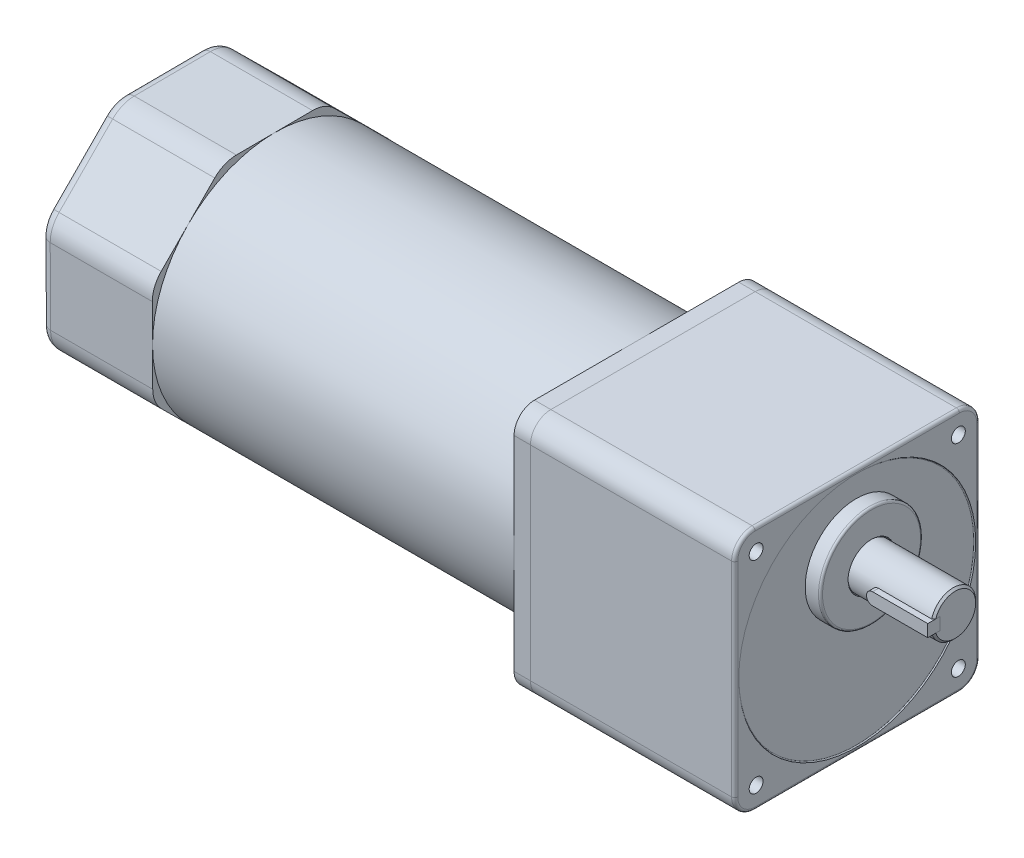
ISO-10303-21;
HEADER;
FILE_DESCRIPTION(('STEP AP214'),'2;1');
FILE_NAME('part.step','',(''),(''),'','','');
FILE_SCHEMA(('AUTOMOTIVE_DESIGN { 1 0 10303 214 1 1 1 1 }'));
ENDSEC;
DATA;
#1=APPLICATION_CONTEXT('core data for automotive mechanical design processes');
#2=APPLICATION_PROTOCOL_DEFINITION('international standard','automotive_design',2000,#1);
#3=PRODUCT_CONTEXT('',#1,'mechanical');
#4=PRODUCT('Part','Part','',(#3));
#5=PRODUCT_RELATED_PRODUCT_CATEGORY('part','',(#4));
#6=PRODUCT_DEFINITION_FORMATION('','',#4);
#7=PRODUCT_DEFINITION_CONTEXT('part definition',#1,'design');
#8=PRODUCT_DEFINITION('design','',#6,#7);
#9=PRODUCT_DEFINITION_SHAPE('','',#8);
#10=(LENGTH_UNIT() NAMED_UNIT(*) SI_UNIT(.MILLI.,.METRE.));
#11=(NAMED_UNIT(*) PLANE_ANGLE_UNIT() SI_UNIT($,.RADIAN.));
#12=(NAMED_UNIT(*) SI_UNIT($,.STERADIAN.) SOLID_ANGLE_UNIT());
#13=UNCERTAINTY_MEASURE_WITH_UNIT(LENGTH_MEASURE(1.E-05),#10,'distance_accuracy_value','');
#14=(GEOMETRIC_REPRESENTATION_CONTEXT(3) GLOBAL_UNCERTAINTY_ASSIGNED_CONTEXT((#13)) GLOBAL_UNIT_ASSIGNED_CONTEXT((#10,
#11,#12)) REPRESENTATION_CONTEXT('',''));
#15=CARTESIAN_POINT('',(0.,0.,0.));
#16=DIRECTION('',(0.,0.,1.));
#17=DIRECTION('',(1.,0.,0.));
#18=AXIS2_PLACEMENT_3D('',#15,#16,#17);
#19=CARTESIAN_POINT('',(21.,22.,13.5));
#20=DIRECTION('',(0.,0.,-1.));
#21=DIRECTION('',(-1.,0.,0.));
#22=AXIS2_PLACEMENT_3D('',#19,#20,#21);
#23=CYLINDRICAL_SURFACE('',#22,3.);
#24=CARTESIAN_POINT('',(21.,22.,7.5));
#25=DIRECTION('',(0.,0.,1.));
#26=DIRECTION('',(1.,0.,0.));
#27=AXIS2_PLACEMENT_3D('',#24,#25,#26);
#28=CIRCLE('',#27,3.);
#29=CARTESIAN_POINT('',(21.,25.,7.5));
#30=VERTEX_POINT('',#29);
#31=CARTESIAN_POINT('',(21.,19.,7.5));
#32=VERTEX_POINT('',#31);
#33=EDGE_CURVE('E122',#30,#32,#28,.T.);
#34=ORIENTED_EDGE('',*,*,#33,.T.);
#35=DIRECTION('',(0.,0.,-1.));
#36=VECTOR('',#35,1.);
#37=CARTESIAN_POINT('',(21.,19.,13.5));
#38=LINE('',#37,#36);
#39=CARTESIAN_POINT('',(21.,19.,13.5));
#40=VERTEX_POINT('',#39);
#41=EDGE_CURVE('E12',#40,#32,#38,.T.);
#42=ORIENTED_EDGE('',*,*,#41,.F.);
#43=CARTESIAN_POINT('',(21.,22.,13.5));
#44=DIRECTION('',(0.,0.,1.));
#45=DIRECTION('',(1.,0.,0.));
#46=AXIS2_PLACEMENT_3D('',#43,#44,#45);
#47=CIRCLE('',#46,3.);
#48=CARTESIAN_POINT('',(21.,25.,13.5));
#49=VERTEX_POINT('',#48);
#50=EDGE_CURVE('E104',#49,#40,#47,.T.);
#51=ORIENTED_EDGE('',*,*,#50,.F.);
#52=DIRECTION('',(0.,0.,-1.));
#53=VECTOR('',#52,1.);
#54=CARTESIAN_POINT('',(21.,25.,13.5));
#55=LINE('',#54,#53);
#56=EDGE_CURVE('E118',#49,#30,#55,.T.);
#57=ORIENTED_EDGE('',*,*,#56,.T.);
#58=EDGE_LOOP('',(#34,#42,#51,#57));
#59=FACE_BOUND('',#58,.T.);
#60=ADVANCED_FACE('F52',(#59),#23,.T.);
#61=CARTESIAN_POINT('',(48.,19.,13.5));
#62=DIRECTION('',(0.,1.,0.));
#63=DIRECTION('',(0.,0.,1.));
#64=AXIS2_PLACEMENT_3D('',#61,#62,#63);
#65=PLANE('',#64);
#66=DIRECTION('',(1.,0.,0.));
#67=VECTOR('',#66,1.);
#68=CARTESIAN_POINT('',(48.,19.,7.5));
#69=LINE('',#68,#67);
#70=CARTESIAN_POINT('',(48.,19.,7.5));
#71=VERTEX_POINT('',#70);
#72=EDGE_CURVE('E109',#32,#71,#69,.T.);
#73=ORIENTED_EDGE('',*,*,#72,.T.);
#74=DIRECTION('',(0.,0.,-1.));
#75=VECTOR('',#74,1.);
#76=CARTESIAN_POINT('',(48.,19.,13.5));
#77=LINE('',#76,#75);
#78=CARTESIAN_POINT('',(48.,19.,13.5));
#79=VERTEX_POINT('',#78);
#80=EDGE_CURVE('E61',#79,#71,#77,.T.);
#81=ORIENTED_EDGE('',*,*,#80,.F.);
#82=DIRECTION('',(1.,0.,0.));
#83=VECTOR('',#82,1.);
#84=CARTESIAN_POINT('',(48.,19.,13.5));
#85=LINE('',#84,#83);
#86=EDGE_CURVE('E99',#40,#79,#85,.T.);
#87=ORIENTED_EDGE('',*,*,#86,.F.);
#88=ORIENTED_EDGE('',*,*,#41,.T.);
#89=EDGE_LOOP('',(#73,#81,#87,#88));
#90=FACE_BOUND('',#89,.T.);
#91=ADVANCED_FACE('F108',(#90),#65,.F.);
#92=CARTESIAN_POINT('',(48.,25.,13.5));
#93=DIRECTION('',(-1.,0.,0.));
#94=DIRECTION('',(0.,0.,1.));
#95=AXIS2_PLACEMENT_3D('',#92,#93,#94);
#96=PLANE('',#95);
#97=DIRECTION('',(0.,1.,0.));
#98=VECTOR('',#97,1.);
#99=CARTESIAN_POINT('',(48.,25.,7.5));
#100=LINE('',#99,#98);
#101=CARTESIAN_POINT('',(48.,25.,7.5));
#102=VERTEX_POINT('',#101);
#103=EDGE_CURVE('E86',#71,#102,#100,.T.);
#104=ORIENTED_EDGE('',*,*,#103,.T.);
#105=DIRECTION('',(0.,0.,-1.));
#106=VECTOR('',#105,1.);
#107=CARTESIAN_POINT('',(48.,25.,13.5));
#108=LINE('',#107,#106);
#109=CARTESIAN_POINT('',(48.,25.,13.5));
#110=VERTEX_POINT('',#109);
#111=EDGE_CURVE('E111',#110,#102,#108,.T.);
#112=ORIENTED_EDGE('',*,*,#111,.F.);
#113=DIRECTION('',(0.,1.,0.));
#114=VECTOR('',#113,1.);
#115=CARTESIAN_POINT('',(48.,25.,13.5));
#116=LINE('',#115,#114);
#117=EDGE_CURVE('E102',#79,#110,#116,.T.);
#118=ORIENTED_EDGE('',*,*,#117,.F.);
#119=ORIENTED_EDGE('',*,*,#80,.T.);
#120=EDGE_LOOP('',(#104,#112,#118,#119));
#121=FACE_BOUND('',#120,.T.);
#122=ADVANCED_FACE('F112',(#121),#96,.F.);
#123=CARTESIAN_POINT('',(21.,25.,13.5));
#124=DIRECTION('',(0.,-1.,0.));
#125=DIRECTION('',(0.,0.,-1.));
#126=AXIS2_PLACEMENT_3D('',#123,#124,#125);
#127=PLANE('',#126);
#128=DIRECTION('',(-1.,0.,0.));
#129=VECTOR('',#128,1.);
#130=CARTESIAN_POINT('',(21.,25.,7.5));
#131=LINE('',#130,#129);
#132=EDGE_CURVE('E92',#102,#30,#131,.T.);
#133=ORIENTED_EDGE('',*,*,#132,.T.);
#134=ORIENTED_EDGE('',*,*,#56,.F.);
#135=DIRECTION('',(-1.,0.,0.));
#136=VECTOR('',#135,1.);
#137=CARTESIAN_POINT('',(21.,25.,13.5));
#138=LINE('',#137,#136);
#139=EDGE_CURVE('E69',#110,#49,#138,.T.);
#140=ORIENTED_EDGE('',*,*,#139,.F.);
#141=ORIENTED_EDGE('',*,*,#111,.T.);
#142=EDGE_LOOP('',(#133,#134,#140,#141));
#143=FACE_BOUND('',#142,.T.);
#144=ADVANCED_FACE('F134',(#143),#127,.F.);
#145=CARTESIAN_POINT('',(21.,22.,13.5));
#146=DIRECTION('',(0.,0.,1.));
#147=DIRECTION('',(1.,0.,0.));
#148=AXIS2_PLACEMENT_3D('',#145,#146,#147);
#149=PLANE('',#148);
#150=ORIENTED_EDGE('',*,*,#50,.T.);
#151=ORIENTED_EDGE('',*,*,#86,.T.);
#152=ORIENTED_EDGE('',*,*,#117,.T.);
#153=ORIENTED_EDGE('',*,*,#139,.T.);
#154=EDGE_LOOP('',(#150,#151,#152,#153));
#155=FACE_BOUND('',#154,.T.);
#156=ADVANCED_FACE('F100',(#155),#149,.T.);
#157=CARTESIAN_POINT('',(21.,22.,7.5));
#158=DIRECTION('',(0.,0.,1.));
#159=DIRECTION('',(1.,0.,0.));
#160=AXIS2_PLACEMENT_3D('',#157,#158,#159);
#161=PLANE('',#160);
#162=ORIENTED_EDGE('',*,*,#33,.F.);
#163=ORIENTED_EDGE('',*,*,#132,.F.);
#164=ORIENTED_EDGE('',*,*,#103,.F.);
#165=ORIENTED_EDGE('',*,*,#72,.F.);
#166=EDGE_LOOP('',(#162,#163,#164,#165));
#167=FACE_BOUND('',#166,.T.);
#168=ADVANCED_FACE('F137',(#167),#161,.F.);
#169=CLOSED_SHELL('',(#60,#91,#122,#144,#156,#168));
#170=MANIFOLD_SOLID_BREP('B2',#169);
#171=CARTESIAN_POINT('',(-108.,-50.,-50.));
#172=DIRECTION('',(1.,0.,0.));
#173=DIRECTION('',(0.,0.,-1.));
#174=AXIS2_PLACEMENT_3D('',#171,#172,#173);
#175=CYLINDRICAL_SURFACE('',#174,9.99999999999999);
#176=CARTESIAN_POINT('',(-100.,-50.,-50.));
#177=DIRECTION('',(-1.,0.,0.));
#178=DIRECTION('',(0.,0.,1.));
#179=AXIS2_PLACEMENT_3D('',#176,#177,#178);
#180=CIRCLE('',#179,9.99999999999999);
#181=CARTESIAN_POINT('',(-100.,-49.9999999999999,-60.));
#182=VERTEX_POINT('',#181);
#183=CARTESIAN_POINT('',(-100.,-60.,-49.9999999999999));
#184=VERTEX_POINT('',#183);
#185=EDGE_CURVE('E306',#182,#184,#180,.T.);
#186=ORIENTED_EDGE('',*,*,#185,.T.);
#187=DIRECTION('',(1.,0.,0.));
#188=VECTOR('',#187,1.);
#189=CARTESIAN_POINT('',(-108.,-60.,-49.9999999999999));
#190=LINE('',#189,#188);
#191=CARTESIAN_POINT('',(-108.,-60.,-49.9999999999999));
#192=VERTEX_POINT('',#191);
#193=EDGE_CURVE('E50',#192,#184,#190,.T.);
#194=ORIENTED_EDGE('',*,*,#193,.F.);
#195=CARTESIAN_POINT('',(-108.,-50.,-50.));
#196=DIRECTION('',(-1.,0.,0.));
#197=DIRECTION('',(0.,0.,1.));
#198=AXIS2_PLACEMENT_3D('',#195,#196,#197);
#199=CIRCLE('',#198,9.99999999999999);
#200=CARTESIAN_POINT('',(-108.,-49.9999999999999,-60.));
#201=VERTEX_POINT('',#200);
#202=EDGE_CURVE('E327',#201,#192,#199,.T.);
#203=ORIENTED_EDGE('',*,*,#202,.F.);
#204=DIRECTION('',(1.,0.,0.));
#205=VECTOR('',#204,1.);
#206=CARTESIAN_POINT('',(-108.,-49.9999999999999,-60.));
#207=LINE('',#206,#205);
#208=EDGE_CURVE('E302',#201,#182,#207,.T.);
#209=ORIENTED_EDGE('',*,*,#208,.T.);
#210=EDGE_LOOP('',(#186,#194,#203,#209));
#211=FACE_BOUND('',#210,.T.);
#212=ADVANCED_FACE('F204',(#211),#175,.T.);
#213=CARTESIAN_POINT('',(-108.,-60.,-49.9999999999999));
#214=DIRECTION('',(0.,1.,0.));
#215=DIRECTION('',(0.,0.,1.));
#216=AXIS2_PLACEMENT_3D('',#213,#214,#215);
#217=PLANE('',#216);
#218=DIRECTION('',(0.,0.,1.));
#219=VECTOR('',#218,1.);
#220=CARTESIAN_POINT('',(-100.,-60.,-49.9999999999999));
#221=LINE('',#220,#219);
#222=CARTESIAN_POINT('',(-100.,-60.,49.9999999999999));
#223=VERTEX_POINT('',#222);
#224=EDGE_CURVE('E310',#184,#223,#221,.T.);
#225=ORIENTED_EDGE('',*,*,#224,.T.);
#226=DIRECTION('',(1.,0.,0.));
#227=VECTOR('',#226,1.);
#228=CARTESIAN_POINT('',(-108.,-60.,49.9999999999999));
#229=LINE('',#228,#227);
#230=CARTESIAN_POINT('',(-108.,-60.,49.9999999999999));
#231=VERTEX_POINT('',#230);
#232=EDGE_CURVE('E213',#231,#223,#229,.T.);
#233=ORIENTED_EDGE('',*,*,#232,.F.);
#234=DIRECTION('',(0.,0.,1.));
#235=VECTOR('',#234,1.);
#236=CARTESIAN_POINT('',(-108.,-60.,-49.9999999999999));
#237=LINE('',#236,#235);
#238=EDGE_CURVE('E264',#192,#231,#237,.T.);
#239=ORIENTED_EDGE('',*,*,#238,.F.);
#240=ORIENTED_EDGE('',*,*,#193,.T.);
#241=EDGE_LOOP('',(#225,#233,#239,#240));
#242=FACE_BOUND('',#241,.T.);
#243=ADVANCED_FACE('F373',(#242),#217,.F.);
#244=CARTESIAN_POINT('',(-108.,-50.,50.));
#245=DIRECTION('',(1.,0.,0.));
#246=DIRECTION('',(0.,0.,-1.));
#247=AXIS2_PLACEMENT_3D('',#244,#245,#246);
#248=CYLINDRICAL_SURFACE('',#247,9.99999999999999);
#249=CARTESIAN_POINT('',(-100.,-50.,50.));
#250=DIRECTION('',(-1.,0.,0.));
#251=DIRECTION('',(0.,0.,1.));
#252=AXIS2_PLACEMENT_3D('',#249,#250,#251);
#253=CIRCLE('',#252,9.99999999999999);
#254=CARTESIAN_POINT('',(-100.,-49.9999999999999,60.));
#255=VERTEX_POINT('',#254);
#256=EDGE_CURVE('E313',#223,#255,#253,.T.);
#257=ORIENTED_EDGE('',*,*,#256,.T.);
#258=DIRECTION('',(1.,0.,0.));
#259=VECTOR('',#258,1.);
#260=CARTESIAN_POINT('',(-108.,-49.9999999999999,60.));
#261=LINE('',#260,#259);
#262=CARTESIAN_POINT('',(-108.,-49.9999999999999,60.));
#263=VERTEX_POINT('',#262);
#264=EDGE_CURVE('E338',#263,#255,#261,.T.);
#265=ORIENTED_EDGE('',*,*,#264,.F.);
#266=CARTESIAN_POINT('',(-108.,-50.,50.));
#267=DIRECTION('',(-1.,0.,0.));
#268=DIRECTION('',(0.,0.,1.));
#269=AXIS2_PLACEMENT_3D('',#266,#267,#268);
#270=CIRCLE('',#269,9.99999999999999);
#271=EDGE_CURVE('E348',#231,#263,#270,.T.);
#272=ORIENTED_EDGE('',*,*,#271,.F.);
#273=ORIENTED_EDGE('',*,*,#232,.T.);
#274=EDGE_LOOP('',(#257,#265,#272,#273));
#275=FACE_BOUND('',#274,.T.);
#276=ADVANCED_FACE('F346',(#275),#248,.T.);
#277=CARTESIAN_POINT('',(-108.,-49.9999999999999,60.));
#278=DIRECTION('',(0.,0.,-1.));
#279=DIRECTION('',(-1.,0.,0.));
#280=AXIS2_PLACEMENT_3D('',#277,#278,#279);
#281=PLANE('',#280);
#282=DIRECTION('',(0.,1.,0.));
#283=VECTOR('',#282,1.);
#284=CARTESIAN_POINT('',(-100.,-49.9999999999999,60.));
#285=LINE('',#284,#283);
#286=CARTESIAN_POINT('',(-100.,49.9999999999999,60.));
#287=VERTEX_POINT('',#286);
#288=EDGE_CURVE('E316',#255,#287,#285,.T.);
#289=ORIENTED_EDGE('',*,*,#288,.T.);
#290=DIRECTION('',(1.,0.,0.));
#291=VECTOR('',#290,1.);
#292=CARTESIAN_POINT('',(-108.,49.9999999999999,60.));
#293=LINE('',#292,#291);
#294=CARTESIAN_POINT('',(-108.,49.9999999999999,60.));
#295=VERTEX_POINT('',#294);
#296=EDGE_CURVE('E334',#295,#287,#293,.T.);
#297=ORIENTED_EDGE('',*,*,#296,.F.);
#298=DIRECTION('',(0.,1.,0.));
#299=VECTOR('',#298,1.);
#300=CARTESIAN_POINT('',(-108.,-49.9999999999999,60.));
#301=LINE('',#300,#299);
#302=EDGE_CURVE('E361',#263,#295,#301,.T.);
#303=ORIENTED_EDGE('',*,*,#302,.F.);
#304=ORIENTED_EDGE('',*,*,#264,.T.);
#305=EDGE_LOOP('',(#289,#297,#303,#304));
#306=FACE_BOUND('',#305,.T.);
#307=ADVANCED_FACE('F356',(#306),#281,.F.);
#308=CARTESIAN_POINT('',(-108.,50.,50.));
#309=DIRECTION('',(1.,0.,0.));
#310=DIRECTION('',(0.,0.,-1.));
#311=AXIS2_PLACEMENT_3D('',#308,#309,#310);
#312=CYLINDRICAL_SURFACE('',#311,9.99999999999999);
#313=CARTESIAN_POINT('',(-100.,50.,50.));
#314=DIRECTION('',(-1.,0.,0.));
#315=DIRECTION('',(0.,0.,1.));
#316=AXIS2_PLACEMENT_3D('',#313,#314,#315);
#317=CIRCLE('',#316,9.99999999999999);
#318=CARTESIAN_POINT('',(-100.,60.,49.9999999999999));
#319=VERTEX_POINT('',#318);
#320=EDGE_CURVE('E319',#287,#319,#317,.T.);
#321=ORIENTED_EDGE('',*,*,#320,.T.);
#322=DIRECTION('',(1.,0.,0.));
#323=VECTOR('',#322,1.);
#324=CARTESIAN_POINT('',(-108.,60.,49.9999999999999));
#325=LINE('',#324,#323);
#326=CARTESIAN_POINT('',(-108.,60.,49.9999999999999));
#327=VERTEX_POINT('',#326);
#328=EDGE_CURVE('E294',#327,#319,#325,.T.);
#329=ORIENTED_EDGE('',*,*,#328,.F.);
#330=CARTESIAN_POINT('',(-108.,50.,50.));
#331=DIRECTION('',(-1.,0.,0.));
#332=DIRECTION('',(0.,0.,1.));
#333=AXIS2_PLACEMENT_3D('',#330,#331,#332);
#334=CIRCLE('',#333,9.99999999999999);
#335=EDGE_CURVE('E283',#295,#327,#334,.T.);
#336=ORIENTED_EDGE('',*,*,#335,.F.);
#337=ORIENTED_EDGE('',*,*,#296,.T.);
#338=EDGE_LOOP('',(#321,#329,#336,#337));
#339=FACE_BOUND('',#338,.T.);
#340=ADVANCED_FACE('F359',(#339),#312,.T.);
#341=CARTESIAN_POINT('',(-108.,60.,-49.9999999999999));
#342=DIRECTION('',(0.,-1.,0.));
#343=DIRECTION('',(0.,0.,-1.));
#344=AXIS2_PLACEMENT_3D('',#341,#342,#343);
#345=PLANE('',#344);
#346=DIRECTION('',(0.,0.,-1.));
#347=VECTOR('',#346,1.);
#348=CARTESIAN_POINT('',(-100.,60.,-49.9999999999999));
#349=LINE('',#348,#347);
#350=CARTESIAN_POINT('',(-100.,60.,-49.9999999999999));
#351=VERTEX_POINT('',#350);
#352=EDGE_CURVE('E292',#319,#351,#349,.T.);
#353=ORIENTED_EDGE('',*,*,#352,.T.);
#354=DIRECTION('',(1.,0.,0.));
#355=VECTOR('',#354,1.);
#356=CARTESIAN_POINT('',(-108.,60.,-49.9999999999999));
#357=LINE('',#356,#355);
#358=CARTESIAN_POINT('',(-108.,60.,-49.9999999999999));
#359=VERTEX_POINT('',#358);
#360=EDGE_CURVE('E289',#359,#351,#357,.T.);
#361=ORIENTED_EDGE('',*,*,#360,.F.);
#362=DIRECTION('',(0.,0.,-1.));
#363=VECTOR('',#362,1.);
#364=CARTESIAN_POINT('',(-108.,60.,-49.9999999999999));
#365=LINE('',#364,#363);
#366=EDGE_CURVE('E277',#327,#359,#365,.T.);
#367=ORIENTED_EDGE('',*,*,#366,.F.);
#368=ORIENTED_EDGE('',*,*,#328,.T.);
#369=EDGE_LOOP('',(#353,#361,#367,#368));
#370=FACE_BOUND('',#369,.T.);
#371=ADVANCED_FACE('F290',(#370),#345,.F.);
#372=CARTESIAN_POINT('',(-108.,50.,-50.));
#373=DIRECTION('',(1.,0.,0.));
#374=DIRECTION('',(0.,0.,-1.));
#375=AXIS2_PLACEMENT_3D('',#372,#373,#374);
#376=CYLINDRICAL_SURFACE('',#375,9.99999999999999);
#377=CARTESIAN_POINT('',(-100.,50.,-50.));
#378=DIRECTION('',(-1.,0.,0.));
#379=DIRECTION('',(0.,0.,-1.));
#380=AXIS2_PLACEMENT_3D('',#377,#378,#379);
#381=CIRCLE('',#380,9.99999999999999);
#382=CARTESIAN_POINT('',(-100.,49.9999999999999,-60.));
#383=VERTEX_POINT('',#382);
#384=EDGE_CURVE('E250',#351,#383,#381,.T.);
#385=ORIENTED_EDGE('',*,*,#384,.T.);
#386=DIRECTION('',(1.,0.,0.));
#387=VECTOR('',#386,1.);
#388=CARTESIAN_POINT('',(-108.,49.9999999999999,-60.));
#389=LINE('',#388,#387);
#390=CARTESIAN_POINT('',(-108.,49.9999999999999,-60.));
#391=VERTEX_POINT('',#390);
#392=EDGE_CURVE('E295',#391,#383,#389,.T.);
#393=ORIENTED_EDGE('',*,*,#392,.F.);
#394=CARTESIAN_POINT('',(-108.,50.,-50.));
#395=DIRECTION('',(-1.,0.,0.));
#396=DIRECTION('',(0.,0.,-1.));
#397=AXIS2_PLACEMENT_3D('',#394,#395,#396);
#398=CIRCLE('',#397,9.99999999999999);
#399=EDGE_CURVE('E281',#359,#391,#398,.T.);
#400=ORIENTED_EDGE('',*,*,#399,.F.);
#401=ORIENTED_EDGE('',*,*,#360,.T.);
#402=EDGE_LOOP('',(#385,#393,#400,#401));
#403=FACE_BOUND('',#402,.T.);
#404=ADVANCED_FACE('F297',(#403),#376,.T.);
#405=CARTESIAN_POINT('',(-108.,-49.9999999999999,-60.));
#406=DIRECTION('',(0.,0.,1.));
#407=DIRECTION('',(1.,0.,0.));
#408=AXIS2_PLACEMENT_3D('',#405,#406,#407);
#409=PLANE('',#408);
#410=DIRECTION('',(0.,-1.,0.));
#411=VECTOR('',#410,1.);
#412=CARTESIAN_POINT('',(-100.,-49.9999999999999,-60.));
#413=LINE('',#412,#411);
#414=EDGE_CURVE('E256',#383,#182,#413,.T.);
#415=ORIENTED_EDGE('',*,*,#414,.T.);
#416=ORIENTED_EDGE('',*,*,#208,.F.);
#417=DIRECTION('',(0.,-1.,0.));
#418=VECTOR('',#417,1.);
#419=CARTESIAN_POINT('',(-108.,-49.9999999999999,-60.));
#420=LINE('',#419,#418);
#421=EDGE_CURVE('E221',#391,#201,#420,.T.);
#422=ORIENTED_EDGE('',*,*,#421,.F.);
#423=ORIENTED_EDGE('',*,*,#392,.T.);
#424=EDGE_LOOP('',(#415,#416,#422,#423));
#425=FACE_BOUND('',#424,.T.);
#426=ADVANCED_FACE('F389',(#425),#409,.F.);
#427=CARTESIAN_POINT('',(-108.,-50.,-50.));
#428=DIRECTION('',(-1.,0.,0.));
#429=DIRECTION('',(0.,0.,1.));
#430=AXIS2_PLACEMENT_3D('',#427,#428,#429);
#431=PLANE('',#430);
#432=ORIENTED_EDGE('',*,*,#202,.T.);
#433=ORIENTED_EDGE('',*,*,#238,.T.);
#434=ORIENTED_EDGE('',*,*,#271,.T.);
#435=ORIENTED_EDGE('',*,*,#302,.T.);
#436=ORIENTED_EDGE('',*,*,#335,.T.);
#437=ORIENTED_EDGE('',*,*,#366,.T.);
#438=ORIENTED_EDGE('',*,*,#399,.T.);
#439=ORIENTED_EDGE('',*,*,#421,.T.);
#440=EDGE_LOOP('',(#432,#433,#434,#435,#436,#437,#438,#439));
#441=FACE_BOUND('',#440,.T.);
#442=ADVANCED_FACE('F279',(#441),#431,.T.);
#443=CARTESIAN_POINT('',(-100.,-50.,-50.));
#444=DIRECTION('',(-1.,0.,0.));
#445=DIRECTION('',(0.,0.,1.));
#446=AXIS2_PLACEMENT_3D('',#443,#444,#445);
#447=PLANE('',#446);
#448=ORIENTED_EDGE('',*,*,#185,.F.);
#449=ORIENTED_EDGE('',*,*,#414,.F.);
#450=ORIENTED_EDGE('',*,*,#384,.F.);
#451=ORIENTED_EDGE('',*,*,#352,.F.);
#452=ORIENTED_EDGE('',*,*,#320,.F.);
#453=ORIENTED_EDGE('',*,*,#288,.F.);
#454=ORIENTED_EDGE('',*,*,#256,.F.);
#455=ORIENTED_EDGE('',*,*,#224,.F.);
#456=EDGE_LOOP('',(#448,#449,#450,#451,#452,#453,#454,#455));
#457=FACE_BOUND('',#456,.T.);
#458=ADVANCED_FACE('F352',(#457),#447,.F.);
#459=CLOSED_SHELL('',(#212,#243,#276,#307,#340,#371,#404,#426,#442,#458));
#460=MANIFOLD_SOLID_BREP('B6',#459);
#461=CARTESIAN_POINT('',(-285.,0.,0.));
#462=DIRECTION('',(1.,0.,0.));
#463=DIRECTION('',(0.,0.,-1.));
#464=AXIS2_PLACEMENT_3D('',#461,#462,#463);
#465=CYLINDRICAL_SURFACE('',#464,60.);
#466=CARTESIAN_POINT('',(-285.,0.,0.));
#467=DIRECTION('',(-1.,0.,0.));
#468=DIRECTION('',(0.,0.,1.));
#469=AXIS2_PLACEMENT_3D('',#466,#467,#468);
#470=CIRCLE('',#469,60.);
#471=CARTESIAN_POINT('',(-285.,42.2026597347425,42.64898019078));
#472=VERTEX_POINT('',#471);
#473=CARTESIAN_POINT('',(-285.,59.9991699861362,0.315596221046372));
#474=VERTEX_POINT('',#473);
#475=EDGE_CURVE('E801',#472,#474,#470,.T.);
#476=ORIENTED_EDGE('',*,*,#475,.F.);
#477=CARTESIAN_POINT('',(-285.,-0.315596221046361,59.9991699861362));
#478=VERTEX_POINT('',#477);
#479=EDGE_CURVE('E807',#478,#472,#470,.T.);
#480=ORIENTED_EDGE('',*,*,#479,.F.);
#481=CARTESIAN_POINT('',(-285.,-42.64898019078,42.2026597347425));
#482=VERTEX_POINT('',#481);
#483=EDGE_CURVE('E1108',#482,#478,#470,.T.);
#484=ORIENTED_EDGE('',*,*,#483,.F.);
#485=CARTESIAN_POINT('',(-285.,-59.9991699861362,-0.315596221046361));
#486=VERTEX_POINT('',#485);
#487=EDGE_CURVE('E1076',#486,#482,#470,.T.);
#488=ORIENTED_EDGE('',*,*,#487,.F.);
#489=CARTESIAN_POINT('',(-285.,-42.2026597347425,-42.64898019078));
#490=VERTEX_POINT('',#489);
#491=EDGE_CURVE('E998',#490,#486,#470,.T.);
#492=ORIENTED_EDGE('',*,*,#491,.F.);
#493=CARTESIAN_POINT('',(-285.,0.315596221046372,-59.9991699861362));
#494=VERTEX_POINT('',#493);
#495=EDGE_CURVE('E1072',#494,#490,#470,.T.);
#496=ORIENTED_EDGE('',*,*,#495,.F.);
#497=CARTESIAN_POINT('',(-285.,42.64898019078,-42.2026597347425));
#498=VERTEX_POINT('',#497);
#499=EDGE_CURVE('E678',#498,#494,#470,.T.);
#500=ORIENTED_EDGE('',*,*,#499,.F.);
#501=EDGE_CURVE('E806',#474,#498,#470,.T.);
#502=ORIENTED_EDGE('',*,*,#501,.F.);
#503=EDGE_LOOP('',(#476,#480,#484,#488,#492,#496,#500,#502));
#504=FACE_BOUND('',#503,.T.);
#505=CARTESIAN_POINT('',(-100.,0.,0.));
#506=DIRECTION('',(-1.,0.,0.));
#507=DIRECTION('',(0.,0.,1.));
#508=AXIS2_PLACEMENT_3D('',#505,#506,#507);
#509=CIRCLE('',#508,60.);
#510=CARTESIAN_POINT('',(-100.,0.,60.));
#511=VERTEX_POINT('',#510);
#512=EDGE_CURVE('E669',#511,#511,#509,.T.);
#513=ORIENTED_EDGE('',*,*,#512,.T.);
#514=EDGE_LOOP('',(#513));
#515=FACE_BOUND('',#514,.T.);
#516=ADVANCED_FACE('F475',(#504,#515),#465,.T.);
#517=CARTESIAN_POINT('',(-100.,0.,0.));
#518=DIRECTION('',(-1.,0.,0.));
#519=DIRECTION('',(0.,0.,1.));
#520=AXIS2_PLACEMENT_3D('',#517,#518,#519);
#521=PLANE('',#520);
#522=ORIENTED_EDGE('',*,*,#512,.F.);
#523=EDGE_LOOP('',(#522));
#524=FACE_BOUND('',#523,.T.);
#525=ADVANCED_FACE('F1130',(#524),#521,.F.);
#526=CARTESIAN_POINT('',(-285.,18.8760496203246,-44.9013343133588));
#527=DIRECTION('',(-1.,0.,0.));
#528=DIRECTION('',(0.,0.,1.));
#529=AXIS2_PLACEMENT_3D('',#526,#527,#528);
#530=PLANE('',#529);
#531=DIRECTION('',(0.,0.710816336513,-0.703377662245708));
#532=VECTOR('',#531,1.);
#533=CARTESIAN_POINT('',(-285.,28.9533202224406,55.7596657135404));
#534=LINE('',#533,#532);
#535=CARTESIAN_POINT('',(-285.,55.4519992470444,29.5382946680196));
#536=VERTEX_POINT('',#535);
#537=EDGE_CURVE('E735',#472,#536,#534,.T.);
#538=ORIENTED_EDGE('',*,*,#537,.F.);
#539=ORIENTED_EDGE('',*,*,#475,.T.);
#540=DIRECTION('',(0.,0.00525993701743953,-0.999986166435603));
#541=VECTOR('',#540,1.);
#542=CARTESIAN_POINT('',(-285.,59.9011268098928,18.9549486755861));
#543=LINE('',#542,#541);
#544=CARTESIAN_POINT('',(-285.,59.9011268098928,18.9549486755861));
#545=VERTEX_POINT('',#544);
#546=EDGE_CURVE('E745',#545,#474,#543,.T.);
#547=ORIENTED_EDGE('',*,*,#546,.F.);
#548=CARTESIAN_POINT('',(-285.,44.9013343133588,18.8760496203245));
#549=DIRECTION('',(-1.,0.,0.));
#550=DIRECTION('',(0.,0.,1.));
#551=AXIS2_PLACEMENT_3D('',#548,#549,#550);
#552=CIRCLE('',#551,15.);
#553=EDGE_CURVE('E740',#536,#545,#552,.T.);
#554=ORIENTED_EDGE('',*,*,#553,.F.);
#555=EDGE_LOOP('',(#538,#539,#547,#554));
#556=FACE_BOUND('',#555,.T.);
#557=ADVANCED_FACE('F1094',(#556),#530,.F.);
#558=CARTESIAN_POINT('',(-285.,60.0972131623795,-18.3237562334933));
#559=VERTEX_POINT('',#558);
#560=EDGE_CURVE('E744',#474,#559,#543,.T.);
#561=ORIENTED_EDGE('',*,*,#560,.F.);
#562=ORIENTED_EDGE('',*,*,#501,.T.);
#563=DIRECTION('',(0.,-0.703377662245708,-0.710816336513));
#564=VECTOR('',#563,1.);
#565=CARTESIAN_POINT('',(-285.,55.7596657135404,-28.9533202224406));
#566=LINE('',#565,#564);
#567=CARTESIAN_POINT('',(-285.,55.7596657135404,-28.9533202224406));
#568=VERTEX_POINT('',#567);
#569=EDGE_CURVE('E754',#568,#498,#566,.T.);
#570=ORIENTED_EDGE('',*,*,#569,.F.);
#571=CARTESIAN_POINT('',(-285.,45.0974206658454,-18.402655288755));
#572=DIRECTION('',(-1.,0.,0.));
#573=DIRECTION('',(0.,0.,-1.));
#574=AXIS2_PLACEMENT_3D('',#571,#572,#573);
#575=CIRCLE('',#574,15.);
#576=EDGE_CURVE('E749',#559,#568,#575,.T.);
#577=ORIENTED_EDGE('',*,*,#576,.F.);
#578=EDGE_LOOP('',(#561,#562,#570,#577));
#579=FACE_BOUND('',#578,.T.);
#580=ADVANCED_FACE('F1086',(#579),#530,.F.);
#581=CARTESIAN_POINT('',(-285.,29.5382946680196,-55.4519992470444));
#582=VERTEX_POINT('',#581);
#583=EDGE_CURVE('E753',#498,#582,#566,.T.);
#584=ORIENTED_EDGE('',*,*,#583,.F.);
#585=ORIENTED_EDGE('',*,*,#499,.T.);
#586=DIRECTION('',(0.,-0.999986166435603,-0.00525993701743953));
#587=VECTOR('',#586,1.);
#588=CARTESIAN_POINT('',(-285.,18.9549486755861,-59.9011268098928));
#589=LINE('',#588,#587);
#590=CARTESIAN_POINT('',(-285.,18.9549486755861,-59.9011268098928));
#591=VERTEX_POINT('',#590);
#592=EDGE_CURVE('E664',#591,#494,#589,.T.);
#593=ORIENTED_EDGE('',*,*,#592,.F.);
#594=CARTESIAN_POINT('',(-285.,18.8760496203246,-44.9013343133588));
#595=DIRECTION('',(-1.,0.,0.));
#596=DIRECTION('',(0.,0.,1.));
#597=AXIS2_PLACEMENT_3D('',#594,#595,#596);
#598=CIRCLE('',#597,15.);
#599=EDGE_CURVE('E677',#582,#591,#598,.T.);
#600=ORIENTED_EDGE('',*,*,#599,.F.);
#601=EDGE_LOOP('',(#584,#585,#593,#600));
#602=FACE_BOUND('',#601,.T.);
#603=ADVANCED_FACE('F676',(#602),#530,.F.);
#604=CARTESIAN_POINT('',(-285.,-18.3237562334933,-60.0972131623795));
#605=VERTEX_POINT('',#604);
#606=EDGE_CURVE('E682',#494,#605,#589,.T.);
#607=ORIENTED_EDGE('',*,*,#606,.F.);
#608=ORIENTED_EDGE('',*,*,#495,.T.);
#609=DIRECTION('',(0.,-0.710816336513,0.703377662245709));
#610=VECTOR('',#609,1.);
#611=CARTESIAN_POINT('',(-285.,-28.9533202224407,-55.7596657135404));
#612=LINE('',#611,#610);
#613=CARTESIAN_POINT('',(-285.,-28.9533202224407,-55.7596657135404));
#614=VERTEX_POINT('',#613);
#615=EDGE_CURVE('E701',#614,#490,#612,.T.);
#616=ORIENTED_EDGE('',*,*,#615,.F.);
#617=CARTESIAN_POINT('',(-285.,-18.402655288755,-45.0974206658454));
#618=DIRECTION('',(-1.,0.,0.));
#619=DIRECTION('',(0.,0.,1.));
#620=AXIS2_PLACEMENT_3D('',#617,#618,#619);
#621=CIRCLE('',#620,15.);
#622=EDGE_CURVE('E681',#605,#614,#621,.T.);
#623=ORIENTED_EDGE('',*,*,#622,.F.);
#624=EDGE_LOOP('',(#607,#608,#616,#623));
#625=FACE_BOUND('',#624,.T.);
#626=ADVANCED_FACE('F1455',(#625),#530,.F.);
#627=CARTESIAN_POINT('',(-285.,-55.4519992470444,-29.5382946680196));
#628=VERTEX_POINT('',#627);
#629=EDGE_CURVE('E700',#490,#628,#612,.T.);
#630=ORIENTED_EDGE('',*,*,#629,.F.);
#631=ORIENTED_EDGE('',*,*,#491,.T.);
#632=DIRECTION('',(0.,-0.00525993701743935,0.999986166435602));
#633=VECTOR('',#632,1.);
#634=CARTESIAN_POINT('',(-285.,-59.9011268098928,-18.954948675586));
#635=LINE('',#634,#633);
#636=CARTESIAN_POINT('',(-285.,-59.9011268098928,-18.954948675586));
#637=VERTEX_POINT('',#636);
#638=EDGE_CURVE('E710',#637,#486,#635,.T.);
#639=ORIENTED_EDGE('',*,*,#638,.F.);
#640=CARTESIAN_POINT('',(-285.,-44.9013343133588,-18.8760496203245));
#641=DIRECTION('',(-1.,0.,0.));
#642=DIRECTION('',(0.,0.,1.));
#643=AXIS2_PLACEMENT_3D('',#640,#641,#642);
#644=CIRCLE('',#643,15.);
#645=EDGE_CURVE('E705',#628,#637,#644,.T.);
#646=ORIENTED_EDGE('',*,*,#645,.F.);
#647=EDGE_LOOP('',(#630,#631,#639,#646));
#648=FACE_BOUND('',#647,.T.);
#649=ADVANCED_FACE('F997',(#648),#530,.F.);
#650=CARTESIAN_POINT('',(-285.,-60.0972131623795,18.3237562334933));
#651=VERTEX_POINT('',#650);
#652=EDGE_CURVE('E709',#486,#651,#635,.T.);
#653=ORIENTED_EDGE('',*,*,#652,.F.);
#654=ORIENTED_EDGE('',*,*,#487,.T.);
#655=DIRECTION('',(0.,0.703377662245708,0.710816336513));
#656=VECTOR('',#655,1.);
#657=CARTESIAN_POINT('',(-285.,-55.7596657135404,28.9533202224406));
#658=LINE('',#657,#656);
#659=CARTESIAN_POINT('',(-285.,-55.7596657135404,28.9533202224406));
#660=VERTEX_POINT('',#659);
#661=EDGE_CURVE('E718',#660,#482,#658,.T.);
#662=ORIENTED_EDGE('',*,*,#661,.F.);
#663=CARTESIAN_POINT('',(-285.,-45.0974206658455,18.402655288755));
#664=DIRECTION('',(-1.,0.,0.));
#665=DIRECTION('',(0.,0.,1.));
#666=AXIS2_PLACEMENT_3D('',#663,#664,#665);
#667=CIRCLE('',#666,15.);
#668=EDGE_CURVE('E713',#651,#660,#667,.T.);
#669=ORIENTED_EDGE('',*,*,#668,.F.);
#670=EDGE_LOOP('',(#653,#654,#662,#669));
#671=FACE_BOUND('',#670,.T.);
#672=ADVANCED_FACE('F1113',(#671),#530,.F.);
#673=CARTESIAN_POINT('',(-285.,-29.5382946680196,55.4519992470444));
#674=VERTEX_POINT('',#673);
#675=EDGE_CURVE('E717',#482,#674,#658,.T.);
#676=ORIENTED_EDGE('',*,*,#675,.F.);
#677=ORIENTED_EDGE('',*,*,#483,.T.);
#678=DIRECTION('',(0.,0.999986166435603,0.00525993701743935));
#679=VECTOR('',#678,1.);
#680=CARTESIAN_POINT('',(-285.,-18.954948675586,59.9011268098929));
#681=LINE('',#680,#679);
#682=CARTESIAN_POINT('',(-285.,-18.954948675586,59.9011268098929));
#683=VERTEX_POINT('',#682);
#684=EDGE_CURVE('E727',#683,#478,#681,.T.);
#685=ORIENTED_EDGE('',*,*,#684,.F.);
#686=CARTESIAN_POINT('',(-285.,-18.8760496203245,44.9013343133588));
#687=DIRECTION('',(-1.,0.,0.));
#688=DIRECTION('',(0.,0.,1.));
#689=AXIS2_PLACEMENT_3D('',#686,#687,#688);
#690=CIRCLE('',#689,15.);
#691=EDGE_CURVE('E722',#674,#683,#690,.T.);
#692=ORIENTED_EDGE('',*,*,#691,.F.);
#693=EDGE_LOOP('',(#676,#677,#685,#692));
#694=FACE_BOUND('',#693,.T.);
#695=ADVANCED_FACE('F1114',(#694),#530,.F.);
#696=CARTESIAN_POINT('',(-285.,18.3237562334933,60.0972131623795));
#697=VERTEX_POINT('',#696);
#698=EDGE_CURVE('E726',#478,#697,#681,.T.);
#699=ORIENTED_EDGE('',*,*,#698,.F.);
#700=ORIENTED_EDGE('',*,*,#479,.T.);
#701=CARTESIAN_POINT('',(-285.,28.9533202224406,55.7596657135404));
#702=VERTEX_POINT('',#701);
#703=EDGE_CURVE('E736',#702,#472,#534,.T.);
#704=ORIENTED_EDGE('',*,*,#703,.F.);
#705=CARTESIAN_POINT('',(-285.,18.4026552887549,45.0974206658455));
#706=DIRECTION('',(-1.,0.,0.));
#707=DIRECTION('',(0.,0.,1.));
#708=AXIS2_PLACEMENT_3D('',#705,#706,#707);
#709=CIRCLE('',#708,15.);
#710=EDGE_CURVE('E731',#697,#702,#709,.T.);
#711=ORIENTED_EDGE('',*,*,#710,.F.);
#712=EDGE_LOOP('',(#699,#700,#704,#711));
#713=FACE_BOUND('',#712,.T.);
#714=ADVANCED_FACE('F1104',(#713),#530,.F.);
#715=CARTESIAN_POINT('',(-340.,18.8760496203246,-44.9013343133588));
#716=DIRECTION('',(1.,0.,0.));
#717=DIRECTION('',(0.,0.,-1.));
#718=AXIS2_PLACEMENT_3D('',#715,#716,#717);
#719=CYLINDRICAL_SURFACE('',#718,15.);
#720=DIRECTION('',(1.,0.,0.));
#721=VECTOR('',#720,1.);
#722=CARTESIAN_POINT('',(-340.,18.9549486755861,-59.9011268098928));
#723=LINE('',#722,#721);
#724=CARTESIAN_POINT('',(-335.,18.9549486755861,-59.9011268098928));
#725=VERTEX_POINT('',#724);
#726=EDGE_CURVE('E660',#725,#591,#723,.T.);
#727=ORIENTED_EDGE('',*,*,#726,.F.);
#728=CARTESIAN_POINT('',(-335.,18.8760496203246,-44.9013343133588));
#729=DIRECTION('',(-1.,0.,0.));
#730=DIRECTION('',(0.,0.,1.));
#731=AXIS2_PLACEMENT_3D('',#728,#729,#730);
#732=CIRCLE('',#731,15.);
#733=CARTESIAN_POINT('',(-335.,29.5382946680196,-55.4519992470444));
#734=VERTEX_POINT('',#733);
#735=EDGE_CURVE('E202',#725,#734,#732,.F.);
#736=ORIENTED_EDGE('',*,*,#735,.T.);
#737=DIRECTION('',(1.,0.,0.));
#738=VECTOR('',#737,1.);
#739=CARTESIAN_POINT('',(-340.,29.5382946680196,-55.4519992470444));
#740=LINE('',#739,#738);
#741=EDGE_CURVE('E686',#734,#582,#740,.T.);
#742=ORIENTED_EDGE('',*,*,#741,.T.);
#743=ORIENTED_EDGE('',*,*,#599,.T.);
#744=EDGE_LOOP('',(#727,#736,#742,#743));
#745=FACE_BOUND('',#744,.T.);
#746=ADVANCED_FACE('F684',(#745),#719,.T.);
#747=CARTESIAN_POINT('',(-340.,18.9549486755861,-59.9011268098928));
#748=DIRECTION('',(0.,-0.00525993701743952,0.999986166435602));
#749=DIRECTION('',(0.,-0.999986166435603,-0.00525993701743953));
#750=AXIS2_PLACEMENT_3D('',#747,#748,#749);
#751=PLANE('',#750);
#752=DIRECTION('',(1.,0.,0.));
#753=VECTOR('',#752,1.);
#754=CARTESIAN_POINT('',(-340.,-18.3237562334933,-60.0972131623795));
#755=LINE('',#754,#753);
#756=CARTESIAN_POINT('',(-335.,-18.3237562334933,-60.0972131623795));
#757=VERTEX_POINT('',#756);
#758=EDGE_CURVE('E670',#757,#605,#755,.T.);
#759=ORIENTED_EDGE('',*,*,#758,.F.);
#760=DIRECTION('',(0.,-0.999986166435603,-0.00525993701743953));
#761=VECTOR('',#760,1.);
#762=CARTESIAN_POINT('',(-335.,18.9549486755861,-59.9011268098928));
#763=LINE('',#762,#761);
#764=EDGE_CURVE('E485',#757,#725,#763,.F.);
#765=ORIENTED_EDGE('',*,*,#764,.T.);
#766=ORIENTED_EDGE('',*,*,#726,.T.);
#767=ORIENTED_EDGE('',*,*,#592,.T.);
#768=ORIENTED_EDGE('',*,*,#606,.T.);
#769=EDGE_LOOP('',(#759,#765,#766,#767,#768));
#770=FACE_BOUND('',#769,.T.);
#771=ADVANCED_FACE('F662',(#770),#751,.F.);
#772=CARTESIAN_POINT('',(-340.,-18.402655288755,-45.0974206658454));
#773=DIRECTION('',(1.,0.,0.));
#774=DIRECTION('',(0.,0.,-1.));
#775=AXIS2_PLACEMENT_3D('',#772,#773,#774);
#776=CYLINDRICAL_SURFACE('',#775,15.);
#777=DIRECTION('',(1.,0.,0.));
#778=VECTOR('',#777,1.);
#779=CARTESIAN_POINT('',(-340.,-28.9533202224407,-55.7596657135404));
#780=LINE('',#779,#778);
#781=CARTESIAN_POINT('',(-335.,-28.9533202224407,-55.7596657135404));
#782=VERTEX_POINT('',#781);
#783=EDGE_CURVE('E796',#782,#614,#780,.T.);
#784=ORIENTED_EDGE('',*,*,#783,.F.);
#785=CARTESIAN_POINT('',(-335.,-18.402655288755,-45.0974206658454));
#786=DIRECTION('',(-1.,0.,0.));
#787=DIRECTION('',(0.,0.,1.));
#788=AXIS2_PLACEMENT_3D('',#785,#786,#787);
#789=CIRCLE('',#788,15.);
#790=EDGE_CURVE('E500',#782,#757,#789,.F.);
#791=ORIENTED_EDGE('',*,*,#790,.T.);
#792=ORIENTED_EDGE('',*,*,#758,.T.);
#793=ORIENTED_EDGE('',*,*,#622,.T.);
#794=EDGE_LOOP('',(#784,#791,#792,#793));
#795=FACE_BOUND('',#794,.T.);
#796=ADVANCED_FACE('F1402',(#795),#776,.T.);
#797=CARTESIAN_POINT('',(-340.,-28.9533202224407,-55.7596657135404));
#798=DIRECTION('',(0.,0.703377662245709,0.710816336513));
#799=DIRECTION('',(0.,-0.710816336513,0.703377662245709));
#800=AXIS2_PLACEMENT_3D('',#797,#798,#799);
#801=PLANE('',#800);
#802=DIRECTION('',(1.,0.,0.));
#803=VECTOR('',#802,1.);
#804=CARTESIAN_POINT('',(-340.,-55.4519992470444,-29.5382946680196));
#805=LINE('',#804,#803);
#806=CARTESIAN_POINT('',(-335.,-55.4519992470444,-29.5382946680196));
#807=VERTEX_POINT('',#806);
#808=EDGE_CURVE('E793',#807,#628,#805,.T.);
#809=ORIENTED_EDGE('',*,*,#808,.F.);
#810=DIRECTION('',(0.,-0.710816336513,0.703377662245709));
#811=VECTOR('',#810,1.);
#812=CARTESIAN_POINT('',(-335.,-28.9533202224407,-55.7596657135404));
#813=LINE('',#812,#811);
#814=EDGE_CURVE('E896',#807,#782,#813,.F.);
#815=ORIENTED_EDGE('',*,*,#814,.T.);
#816=ORIENTED_EDGE('',*,*,#783,.T.);
#817=ORIENTED_EDGE('',*,*,#615,.T.);
#818=ORIENTED_EDGE('',*,*,#629,.T.);
#819=EDGE_LOOP('',(#809,#815,#816,#817,#818));
#820=FACE_BOUND('',#819,.T.);
#821=ADVANCED_FACE('F989',(#820),#801,.F.);
#822=CARTESIAN_POINT('',(-340.,-44.9013343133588,-18.8760496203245));
#823=DIRECTION('',(1.,0.,0.));
#824=DIRECTION('',(0.,0.,-1.));
#825=AXIS2_PLACEMENT_3D('',#822,#823,#824);
#826=CYLINDRICAL_SURFACE('',#825,15.);
#827=DIRECTION('',(1.,0.,0.));
#828=VECTOR('',#827,1.);
#829=CARTESIAN_POINT('',(-340.,-59.9011268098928,-18.954948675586));
#830=LINE('',#829,#828);
#831=CARTESIAN_POINT('',(-335.,-59.9011268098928,-18.954948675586));
#832=VERTEX_POINT('',#831);
#833=EDGE_CURVE('E790',#832,#637,#830,.T.);
#834=ORIENTED_EDGE('',*,*,#833,.F.);
#835=CARTESIAN_POINT('',(-335.,-44.9013343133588,-18.8760496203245));
#836=DIRECTION('',(-1.,0.,0.));
#837=DIRECTION('',(0.,0.,1.));
#838=AXIS2_PLACEMENT_3D('',#835,#836,#837);
#839=CIRCLE('',#838,15.);
#840=EDGE_CURVE('E893',#832,#807,#839,.F.);
#841=ORIENTED_EDGE('',*,*,#840,.T.);
#842=ORIENTED_EDGE('',*,*,#808,.T.);
#843=ORIENTED_EDGE('',*,*,#645,.T.);
#844=EDGE_LOOP('',(#834,#841,#842,#843));
#845=FACE_BOUND('',#844,.T.);
#846=ADVANCED_FACE('F986',(#845),#826,.T.);
#847=CARTESIAN_POINT('',(-340.,-59.9011268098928,-18.954948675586));
#848=DIRECTION('',(0.,0.999986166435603,0.00525993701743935));
#849=DIRECTION('',(0.,-0.00525993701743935,0.999986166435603));
#850=AXIS2_PLACEMENT_3D('',#847,#848,#849);
#851=PLANE('',#850);
#852=DIRECTION('',(1.,0.,0.));
#853=VECTOR('',#852,1.);
#854=CARTESIAN_POINT('',(-340.,-60.0972131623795,18.3237562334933));
#855=LINE('',#854,#853);
#856=CARTESIAN_POINT('',(-335.,-60.0972131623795,18.3237562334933));
#857=VERTEX_POINT('',#856);
#858=EDGE_CURVE('E787',#857,#651,#855,.T.);
#859=ORIENTED_EDGE('',*,*,#858,.F.);
#860=DIRECTION('',(0.,-0.00525993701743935,0.999986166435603));
#861=VECTOR('',#860,1.);
#862=CARTESIAN_POINT('',(-335.,-59.9011268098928,-18.954948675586));
#863=LINE('',#862,#861);
#864=EDGE_CURVE('E890',#857,#832,#863,.F.);
#865=ORIENTED_EDGE('',*,*,#864,.T.);
#866=ORIENTED_EDGE('',*,*,#833,.T.);
#867=ORIENTED_EDGE('',*,*,#638,.T.);
#868=ORIENTED_EDGE('',*,*,#652,.T.);
#869=EDGE_LOOP('',(#859,#865,#866,#867,#868));
#870=FACE_BOUND('',#869,.T.);
#871=ADVANCED_FACE('F1003',(#870),#851,.F.);
#872=CARTESIAN_POINT('',(-340.,-45.0974206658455,18.402655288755));
#873=DIRECTION('',(1.,0.,0.));
#874=DIRECTION('',(0.,0.,-1.));
#875=AXIS2_PLACEMENT_3D('',#872,#873,#874);
#876=CYLINDRICAL_SURFACE('',#875,15.);
#877=DIRECTION('',(1.,0.,0.));
#878=VECTOR('',#877,1.);
#879=CARTESIAN_POINT('',(-340.,-55.7596657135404,28.9533202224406));
#880=LINE('',#879,#878);
#881=CARTESIAN_POINT('',(-335.,-55.7596657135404,28.9533202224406));
#882=VERTEX_POINT('',#881);
#883=EDGE_CURVE('E784',#882,#660,#880,.T.);
#884=ORIENTED_EDGE('',*,*,#883,.F.);
#885=CARTESIAN_POINT('',(-335.,-45.0974206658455,18.402655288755));
#886=DIRECTION('',(-1.,0.,0.));
#887=DIRECTION('',(0.,0.,1.));
#888=AXIS2_PLACEMENT_3D('',#885,#886,#887);
#889=CIRCLE('',#888,15.);
#890=EDGE_CURVE('E887',#882,#857,#889,.F.);
#891=ORIENTED_EDGE('',*,*,#890,.T.);
#892=ORIENTED_EDGE('',*,*,#858,.T.);
#893=ORIENTED_EDGE('',*,*,#668,.T.);
#894=EDGE_LOOP('',(#884,#891,#892,#893));
#895=FACE_BOUND('',#894,.T.);
#896=ADVANCED_FACE('F1007',(#895),#876,.T.);
#897=CARTESIAN_POINT('',(-340.,-55.7596657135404,28.9533202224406));
#898=DIRECTION('',(0.,0.710816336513,-0.703377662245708));
#899=DIRECTION('',(0.,0.703377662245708,0.710816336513));
#900=AXIS2_PLACEMENT_3D('',#897,#898,#899);
#901=PLANE('',#900);
#902=DIRECTION('',(1.,0.,0.));
#903=VECTOR('',#902,1.);
#904=CARTESIAN_POINT('',(-340.,-29.5382946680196,55.4519992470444));
#905=LINE('',#904,#903);
#906=CARTESIAN_POINT('',(-335.,-29.5382946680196,55.4519992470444));
#907=VERTEX_POINT('',#906);
#908=EDGE_CURVE('E781',#907,#674,#905,.T.);
#909=ORIENTED_EDGE('',*,*,#908,.F.);
#910=DIRECTION('',(0.,0.703377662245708,0.710816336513));
#911=VECTOR('',#910,1.);
#912=CARTESIAN_POINT('',(-335.,-55.7596657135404,28.9533202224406));
#913=LINE('',#912,#911);
#914=EDGE_CURVE('E884',#907,#882,#913,.F.);
#915=ORIENTED_EDGE('',*,*,#914,.T.);
#916=ORIENTED_EDGE('',*,*,#883,.T.);
#917=ORIENTED_EDGE('',*,*,#661,.T.);
#918=ORIENTED_EDGE('',*,*,#675,.T.);
#919=EDGE_LOOP('',(#909,#915,#916,#917,#918));
#920=FACE_BOUND('',#919,.T.);
#921=ADVANCED_FACE('F1011',(#920),#901,.F.);
#922=CARTESIAN_POINT('',(-340.,-18.8760496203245,44.9013343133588));
#923=DIRECTION('',(1.,0.,0.));
#924=DIRECTION('',(0.,0.,-1.));
#925=AXIS2_PLACEMENT_3D('',#922,#923,#924);
#926=CYLINDRICAL_SURFACE('',#925,15.);
#927=DIRECTION('',(1.,0.,0.));
#928=VECTOR('',#927,1.);
#929=CARTESIAN_POINT('',(-340.,-18.954948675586,59.9011268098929));
#930=LINE('',#929,#928);
#931=CARTESIAN_POINT('',(-335.,-18.954948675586,59.9011268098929));
#932=VERTEX_POINT('',#931);
#933=EDGE_CURVE('E778',#932,#683,#930,.T.);
#934=ORIENTED_EDGE('',*,*,#933,.F.);
#935=CARTESIAN_POINT('',(-335.,-18.8760496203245,44.9013343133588));
#936=DIRECTION('',(-1.,0.,0.));
#937=DIRECTION('',(0.,0.,1.));
#938=AXIS2_PLACEMENT_3D('',#935,#936,#937);
#939=CIRCLE('',#938,15.);
#940=EDGE_CURVE('E881',#932,#907,#939,.F.);
#941=ORIENTED_EDGE('',*,*,#940,.T.);
#942=ORIENTED_EDGE('',*,*,#908,.T.);
#943=ORIENTED_EDGE('',*,*,#691,.T.);
#944=EDGE_LOOP('',(#934,#941,#942,#943));
#945=FACE_BOUND('',#944,.T.);
#946=ADVANCED_FACE('F1017',(#945),#926,.T.);
#947=CARTESIAN_POINT('',(-340.,-18.954948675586,59.9011268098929));
#948=DIRECTION('',(0.,0.00525993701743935,-0.999986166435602));
#949=DIRECTION('',(0.,0.999986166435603,0.00525993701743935));
#950=AXIS2_PLACEMENT_3D('',#947,#948,#949);
#951=PLANE('',#950);
#952=DIRECTION('',(1.,0.,0.));
#953=VECTOR('',#952,1.);
#954=CARTESIAN_POINT('',(-340.,18.3237562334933,60.0972131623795));
#955=LINE('',#954,#953);
#956=CARTESIAN_POINT('',(-335.,18.3237562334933,60.0972131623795));
#957=VERTEX_POINT('',#956);
#958=EDGE_CURVE('E775',#957,#697,#955,.T.);
#959=ORIENTED_EDGE('',*,*,#958,.F.);
#960=DIRECTION('',(0.,0.999986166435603,0.00525993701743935));
#961=VECTOR('',#960,1.);
#962=CARTESIAN_POINT('',(-335.,-18.954948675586,59.9011268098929));
#963=LINE('',#962,#961);
#964=EDGE_CURVE('E878',#957,#932,#963,.F.);
#965=ORIENTED_EDGE('',*,*,#964,.T.);
#966=ORIENTED_EDGE('',*,*,#933,.T.);
#967=ORIENTED_EDGE('',*,*,#684,.T.);
#968=ORIENTED_EDGE('',*,*,#698,.T.);
#969=EDGE_LOOP('',(#959,#965,#966,#967,#968));
#970=FACE_BOUND('',#969,.T.);
#971=ADVANCED_FACE('F1117',(#970),#951,.F.);
#972=CARTESIAN_POINT('',(-340.,18.4026552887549,45.0974206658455));
#973=DIRECTION('',(1.,0.,0.));
#974=DIRECTION('',(0.,0.,-1.));
#975=AXIS2_PLACEMENT_3D('',#972,#973,#974);
#976=CYLINDRICAL_SURFACE('',#975,15.);
#977=DIRECTION('',(1.,0.,0.));
#978=VECTOR('',#977,1.);
#979=CARTESIAN_POINT('',(-340.,28.9533202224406,55.7596657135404));
#980=LINE('',#979,#978);
#981=CARTESIAN_POINT('',(-335.,28.9533202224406,55.7596657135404));
#982=VERTEX_POINT('',#981);
#983=EDGE_CURVE('E772',#982,#702,#980,.T.);
#984=ORIENTED_EDGE('',*,*,#983,.F.);
#985=CARTESIAN_POINT('',(-335.,18.4026552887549,45.0974206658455));
#986=DIRECTION('',(-1.,0.,0.));
#987=DIRECTION('',(0.,0.,1.));
#988=AXIS2_PLACEMENT_3D('',#985,#986,#987);
#989=CIRCLE('',#988,15.);
#990=EDGE_CURVE('E875',#982,#957,#989,.F.);
#991=ORIENTED_EDGE('',*,*,#990,.T.);
#992=ORIENTED_EDGE('',*,*,#958,.T.);
#993=ORIENTED_EDGE('',*,*,#710,.T.);
#994=EDGE_LOOP('',(#984,#991,#992,#993));
#995=FACE_BOUND('',#994,.T.);
#996=ADVANCED_FACE('F1119',(#995),#976,.T.);
#997=CARTESIAN_POINT('',(-340.,28.9533202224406,55.7596657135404));
#998=DIRECTION('',(0.,-0.703377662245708,-0.710816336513));
#999=DIRECTION('',(0.,0.710816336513,-0.703377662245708));
#1000=AXIS2_PLACEMENT_3D('',#997,#998,#999);
#1001=PLANE('',#1000);
#1002=DIRECTION('',(1.,0.,0.));
#1003=VECTOR('',#1002,1.);
#1004=CARTESIAN_POINT('',(-340.,55.4519992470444,29.5382946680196));
#1005=LINE('',#1004,#1003);
#1006=CARTESIAN_POINT('',(-335.,55.4519992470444,29.5382946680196));
#1007=VERTEX_POINT('',#1006);
#1008=EDGE_CURVE('E769',#1007,#536,#1005,.T.);
#1009=ORIENTED_EDGE('',*,*,#1008,.F.);
#1010=DIRECTION('',(0.,0.710816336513,-0.703377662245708));
#1011=VECTOR('',#1010,1.);
#1012=CARTESIAN_POINT('',(-335.,28.9533202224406,55.7596657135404));
#1013=LINE('',#1012,#1011);
#1014=EDGE_CURVE('E872',#1007,#982,#1013,.F.);
#1015=ORIENTED_EDGE('',*,*,#1014,.T.);
#1016=ORIENTED_EDGE('',*,*,#983,.T.);
#1017=ORIENTED_EDGE('',*,*,#703,.T.);
#1018=ORIENTED_EDGE('',*,*,#537,.T.);
#1019=EDGE_LOOP('',(#1009,#1015,#1016,#1017,#1018));
#1020=FACE_BOUND('',#1019,.T.);
#1021=ADVANCED_FACE('F1099',(#1020),#1001,.F.);
#1022=CARTESIAN_POINT('',(-340.,44.9013343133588,18.8760496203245));
#1023=DIRECTION('',(1.,0.,0.));
#1024=DIRECTION('',(0.,0.,-1.));
#1025=AXIS2_PLACEMENT_3D('',#1022,#1023,#1024);
#1026=CYLINDRICAL_SURFACE('',#1025,15.);
#1027=DIRECTION('',(1.,0.,0.));
#1028=VECTOR('',#1027,1.);
#1029=CARTESIAN_POINT('',(-340.,59.9011268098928,18.9549486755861));
#1030=LINE('',#1029,#1028);
#1031=CARTESIAN_POINT('',(-335.,59.9011268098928,18.9549486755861));
#1032=VERTEX_POINT('',#1031);
#1033=EDGE_CURVE('E766',#1032,#545,#1030,.T.);
#1034=ORIENTED_EDGE('',*,*,#1033,.F.);
#1035=CARTESIAN_POINT('',(-335.,44.9013343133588,18.8760496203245));
#1036=DIRECTION('',(-1.,0.,0.));
#1037=DIRECTION('',(0.,0.,1.));
#1038=AXIS2_PLACEMENT_3D('',#1035,#1036,#1037);
#1039=CIRCLE('',#1038,15.);
#1040=EDGE_CURVE('E869',#1032,#1007,#1039,.F.);
#1041=ORIENTED_EDGE('',*,*,#1040,.T.);
#1042=ORIENTED_EDGE('',*,*,#1008,.T.);
#1043=ORIENTED_EDGE('',*,*,#553,.T.);
#1044=EDGE_LOOP('',(#1034,#1041,#1042,#1043));
#1045=FACE_BOUND('',#1044,.T.);
#1046=ADVANCED_FACE('F1126',(#1045),#1026,.T.);
#1047=CARTESIAN_POINT('',(-340.,59.9011268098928,18.9549486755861));
#1048=DIRECTION('',(0.,-0.999986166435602,-0.00525993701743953));
#1049=DIRECTION('',(0.,0.00525993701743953,-0.999986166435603));
#1050=AXIS2_PLACEMENT_3D('',#1047,#1048,#1049);
#1051=PLANE('',#1050);
#1052=DIRECTION('',(1.,0.,0.));
#1053=VECTOR('',#1052,1.);
#1054=CARTESIAN_POINT('',(-340.,60.0972131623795,-18.3237562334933));
#1055=LINE('',#1054,#1053);
#1056=CARTESIAN_POINT('',(-335.,60.0972131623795,-18.3237562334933));
#1057=VERTEX_POINT('',#1056);
#1058=EDGE_CURVE('E763',#1057,#559,#1055,.T.);
#1059=ORIENTED_EDGE('',*,*,#1058,.F.);
#1060=DIRECTION('',(0.,0.00525993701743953,-0.999986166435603));
#1061=VECTOR('',#1060,1.);
#1062=CARTESIAN_POINT('',(-335.,59.9011268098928,18.9549486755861));
#1063=LINE('',#1062,#1061);
#1064=EDGE_CURVE('E866',#1057,#1032,#1063,.F.);
#1065=ORIENTED_EDGE('',*,*,#1064,.T.);
#1066=ORIENTED_EDGE('',*,*,#1033,.T.);
#1067=ORIENTED_EDGE('',*,*,#546,.T.);
#1068=ORIENTED_EDGE('',*,*,#560,.T.);
#1069=EDGE_LOOP('',(#1059,#1065,#1066,#1067,#1068));
#1070=FACE_BOUND('',#1069,.T.);
#1071=ADVANCED_FACE('F1188',(#1070),#1051,.F.);
#1072=CARTESIAN_POINT('',(-340.,45.0974206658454,-18.402655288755));
#1073=DIRECTION('',(1.,0.,0.));
#1074=DIRECTION('',(0.,0.,-1.));
#1075=AXIS2_PLACEMENT_3D('',#1072,#1073,#1074);
#1076=CYLINDRICAL_SURFACE('',#1075,15.);
#1077=DIRECTION('',(1.,0.,0.));
#1078=VECTOR('',#1077,1.);
#1079=CARTESIAN_POINT('',(-340.,55.7596657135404,-28.9533202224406));
#1080=LINE('',#1079,#1078);
#1081=CARTESIAN_POINT('',(-335.,55.7596657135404,-28.9533202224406));
#1082=VERTEX_POINT('',#1081);
#1083=EDGE_CURVE('E760',#1082,#568,#1080,.T.);
#1084=ORIENTED_EDGE('',*,*,#1083,.F.);
#1085=CARTESIAN_POINT('',(-335.,45.0974206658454,-18.402655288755));
#1086=DIRECTION('',(-1.,0.,0.));
#1087=DIRECTION('',(0.,0.,1.));
#1088=AXIS2_PLACEMENT_3D('',#1085,#1086,#1087);
#1089=CIRCLE('',#1088,15.);
#1090=EDGE_CURVE('E863',#1082,#1057,#1089,.F.);
#1091=ORIENTED_EDGE('',*,*,#1090,.T.);
#1092=ORIENTED_EDGE('',*,*,#1058,.T.);
#1093=ORIENTED_EDGE('',*,*,#576,.T.);
#1094=EDGE_LOOP('',(#1084,#1091,#1092,#1093));
#1095=FACE_BOUND('',#1094,.T.);
#1096=ADVANCED_FACE('F1181',(#1095),#1076,.T.);
#1097=CARTESIAN_POINT('',(-340.,55.7596657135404,-28.9533202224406));
#1098=DIRECTION('',(0.,-0.710816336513,0.703377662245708));
#1099=DIRECTION('',(0.,-0.703377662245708,-0.710816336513));
#1100=AXIS2_PLACEMENT_3D('',#1097,#1098,#1099);
#1101=PLANE('',#1100);
#1102=ORIENTED_EDGE('',*,*,#741,.F.);
#1103=DIRECTION('',(0.,-0.703377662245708,-0.710816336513));
#1104=VECTOR('',#1103,1.);
#1105=CARTESIAN_POINT('',(-335.,55.7596657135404,-28.9533202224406));
#1106=LINE('',#1105,#1104);
#1107=EDGE_CURVE('E859',#734,#1082,#1106,.F.);
#1108=ORIENTED_EDGE('',*,*,#1107,.T.);
#1109=ORIENTED_EDGE('',*,*,#1083,.T.);
#1110=ORIENTED_EDGE('',*,*,#569,.T.);
#1111=ORIENTED_EDGE('',*,*,#583,.T.);
#1112=EDGE_LOOP('',(#1102,#1108,#1109,#1110,#1111));
#1113=FACE_BOUND('',#1112,.T.);
#1114=ADVANCED_FACE('F1067',(#1113),#1101,.F.);
#1115=CARTESIAN_POINT('',(-340.,18.8760496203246,-44.9013343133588));
#1116=DIRECTION('',(-1.,0.,0.));
#1117=DIRECTION('',(0.,0.,1.));
#1118=AXIS2_PLACEMENT_3D('',#1115,#1116,#1117);
#1119=PLANE('',#1118);
#1120=CARTESIAN_POINT('',(-340.,45.0974206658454,-18.402655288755));
#1121=DIRECTION('',(-1.,0.,0.));
#1122=DIRECTION('',(0.,0.,1.));
#1123=AXIS2_PLACEMENT_3D('',#1120,#1121,#1122);
#1124=CIRCLE('',#1123,10.);
#1125=CARTESIAN_POINT('',(-340.,55.0972823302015,-18.3500559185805));
#1126=VERTEX_POINT('',#1125);
#1127=CARTESIAN_POINT('',(-340.,52.2055840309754,-25.4364319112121));
#1128=VERTEX_POINT('',#1127);
#1129=EDGE_CURVE('E852',#1126,#1128,#1124,.T.);
#1130=ORIENTED_EDGE('',*,*,#1129,.T.);
#1131=DIRECTION('',(0.,-0.703377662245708,-0.710816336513));
#1132=VECTOR('',#1131,1.);
#1133=CARTESIAN_POINT('',(-340.,25.9842129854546,-51.9351109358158));
#1134=LINE('',#1133,#1132);
#1135=CARTESIAN_POINT('',(-340.,25.9842129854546,-51.9351109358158));
#1136=VERTEX_POINT('',#1135);
#1137=EDGE_CURVE('E855',#1128,#1136,#1134,.T.);
#1138=ORIENTED_EDGE('',*,*,#1137,.T.);
#1139=CARTESIAN_POINT('',(-340.,18.8760496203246,-44.9013343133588));
#1140=DIRECTION('',(-1.,0.,0.));
#1141=DIRECTION('',(0.,0.,1.));
#1142=AXIS2_PLACEMENT_3D('',#1139,#1140,#1141);
#1143=CIRCLE('',#1142,10.);
#1144=CARTESIAN_POINT('',(-340.,18.9286489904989,-54.9011959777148));
#1145=VERTEX_POINT('',#1144);
#1146=EDGE_CURVE('E805',#1136,#1145,#1143,.T.);
#1147=ORIENTED_EDGE('',*,*,#1146,.T.);
#1148=DIRECTION('',(0.,-0.999986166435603,-0.00525993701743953));
#1149=VECTOR('',#1148,1.);
#1150=CARTESIAN_POINT('',(-340.,-18.3500559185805,-55.0972823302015));
#1151=LINE('',#1150,#1149);
#1152=CARTESIAN_POINT('',(-340.,-18.3500559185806,-55.0972823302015));
#1153=VERTEX_POINT('',#1152);
#1154=EDGE_CURVE('E813',#1145,#1153,#1151,.T.);
#1155=ORIENTED_EDGE('',*,*,#1154,.T.);
#1156=CARTESIAN_POINT('',(-340.,-18.402655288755,-45.0974206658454));
#1157=DIRECTION('',(-1.,0.,0.));
#1158=DIRECTION('',(0.,0.,1.));
#1159=AXIS2_PLACEMENT_3D('',#1156,#1157,#1158);
#1160=CIRCLE('',#1159,10.);
#1161=CARTESIAN_POINT('',(-340.,-25.4364319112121,-52.2055840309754));
#1162=VERTEX_POINT('',#1161);
#1163=EDGE_CURVE('E816',#1153,#1162,#1160,.T.);
#1164=ORIENTED_EDGE('',*,*,#1163,.T.);
#1165=DIRECTION('',(0.,-0.710816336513,0.703377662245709));
#1166=VECTOR('',#1165,1.);
#1167=CARTESIAN_POINT('',(-340.,-51.9351109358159,-25.9842129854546));
#1168=LINE('',#1167,#1166);
#1169=CARTESIAN_POINT('',(-340.,-51.9351109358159,-25.9842129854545));
#1170=VERTEX_POINT('',#1169);
#1171=EDGE_CURVE('E819',#1162,#1170,#1168,.T.);
#1172=ORIENTED_EDGE('',*,*,#1171,.T.);
#1173=CARTESIAN_POINT('',(-340.,-44.9013343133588,-18.8760496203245));
#1174=DIRECTION('',(-1.,0.,0.));
#1175=DIRECTION('',(0.,0.,1.));
#1176=AXIS2_PLACEMENT_3D('',#1173,#1174,#1175);
#1177=CIRCLE('',#1176,10.);
#1178=CARTESIAN_POINT('',(-340.,-54.9011959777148,-18.9286489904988));
#1179=VERTEX_POINT('',#1178);
#1180=EDGE_CURVE('E822',#1170,#1179,#1177,.T.);
#1181=ORIENTED_EDGE('',*,*,#1180,.T.);
#1182=DIRECTION('',(0.,-0.00525993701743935,0.999986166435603));
#1183=VECTOR('',#1182,1.);
#1184=CARTESIAN_POINT('',(-340.,-55.0972823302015,18.3500559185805));
#1185=LINE('',#1184,#1183);
#1186=CARTESIAN_POINT('',(-340.,-55.0972823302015,18.3500559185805));
#1187=VERTEX_POINT('',#1186);
#1188=EDGE_CURVE('E825',#1179,#1187,#1185,.T.);
#1189=ORIENTED_EDGE('',*,*,#1188,.T.);
#1190=CARTESIAN_POINT('',(-340.,-45.0974206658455,18.402655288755));
#1191=DIRECTION('',(-1.,0.,0.));
#1192=DIRECTION('',(0.,0.,1.));
#1193=AXIS2_PLACEMENT_3D('',#1190,#1191,#1192);
#1194=CIRCLE('',#1193,9.99999999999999);
#1195=CARTESIAN_POINT('',(-340.,-52.2055840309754,25.4364319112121));
#1196=VERTEX_POINT('',#1195);
#1197=EDGE_CURVE('E828',#1187,#1196,#1194,.T.);
#1198=ORIENTED_EDGE('',*,*,#1197,.T.);
#1199=DIRECTION('',(0.,0.703377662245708,0.710816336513));
#1200=VECTOR('',#1199,1.);
#1201=CARTESIAN_POINT('',(-340.,-25.9842129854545,51.9351109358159));
#1202=LINE('',#1201,#1200);
#1203=CARTESIAN_POINT('',(-340.,-25.9842129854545,51.9351109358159));
#1204=VERTEX_POINT('',#1203);
#1205=EDGE_CURVE('E831',#1196,#1204,#1202,.T.);
#1206=ORIENTED_EDGE('',*,*,#1205,.T.);
#1207=CARTESIAN_POINT('',(-340.,-18.8760496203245,44.9013343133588));
#1208=DIRECTION('',(-1.,0.,0.));
#1209=DIRECTION('',(0.,0.,1.));
#1210=AXIS2_PLACEMENT_3D('',#1207,#1208,#1209);
#1211=CIRCLE('',#1210,10.);
#1212=CARTESIAN_POINT('',(-340.,-18.9286489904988,54.9011959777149));
#1213=VERTEX_POINT('',#1212);
#1214=EDGE_CURVE('E834',#1204,#1213,#1211,.T.);
#1215=ORIENTED_EDGE('',*,*,#1214,.T.);
#1216=DIRECTION('',(0.,0.999986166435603,0.00525993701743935));
#1217=VECTOR('',#1216,1.);
#1218=CARTESIAN_POINT('',(-340.,18.3500559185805,55.0972823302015));
#1219=LINE('',#1218,#1217);
#1220=CARTESIAN_POINT('',(-340.,18.3500559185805,55.0972823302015));
#1221=VERTEX_POINT('',#1220);
#1222=EDGE_CURVE('E837',#1213,#1221,#1219,.T.);
#1223=ORIENTED_EDGE('',*,*,#1222,.T.);
#1224=CARTESIAN_POINT('',(-340.,18.4026552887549,45.0974206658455));
#1225=DIRECTION('',(-1.,0.,0.));
#1226=DIRECTION('',(0.,0.,1.));
#1227=AXIS2_PLACEMENT_3D('',#1224,#1225,#1226);
#1228=CIRCLE('',#1227,10.);
#1229=CARTESIAN_POINT('',(-340.,25.4364319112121,52.2055840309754));
#1230=VERTEX_POINT('',#1229);
#1231=EDGE_CURVE('E840',#1221,#1230,#1228,.T.);
#1232=ORIENTED_EDGE('',*,*,#1231,.T.);
#1233=DIRECTION('',(0.,0.710816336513,-0.703377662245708));
#1234=VECTOR('',#1233,1.);
#1235=CARTESIAN_POINT('',(-340.,51.9351109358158,25.9842129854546));
#1236=LINE('',#1235,#1234);
#1237=CARTESIAN_POINT('',(-340.,51.9351109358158,25.9842129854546));
#1238=VERTEX_POINT('',#1237);
#1239=EDGE_CURVE('E843',#1230,#1238,#1236,.T.);
#1240=ORIENTED_EDGE('',*,*,#1239,.T.);
#1241=CARTESIAN_POINT('',(-340.,44.9013343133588,18.8760496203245));
#1242=DIRECTION('',(-1.,0.,0.));
#1243=DIRECTION('',(0.,0.,1.));
#1244=AXIS2_PLACEMENT_3D('',#1241,#1242,#1243);
#1245=CIRCLE('',#1244,10.);
#1246=CARTESIAN_POINT('',(-340.,54.9011959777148,18.9286489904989));
#1247=VERTEX_POINT('',#1246);
#1248=EDGE_CURVE('E846',#1238,#1247,#1245,.T.);
#1249=ORIENTED_EDGE('',*,*,#1248,.T.);
#1250=DIRECTION('',(0.,0.00525993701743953,-0.999986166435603));
#1251=VECTOR('',#1250,1.);
#1252=CARTESIAN_POINT('',(-340.,55.0972823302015,-18.3500559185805));
#1253=LINE('',#1252,#1251);
#1254=EDGE_CURVE('E849',#1247,#1126,#1253,.T.);
#1255=ORIENTED_EDGE('',*,*,#1254,.T.);
#1256=EDGE_LOOP('',(#1130,#1138,#1147,#1155,#1164,#1172,#1181,#1189,#1198,#1206,#1215,#1223,
#1232,#1240,#1249,#1255));
#1257=FACE_BOUND('',#1256,.T.);
#1258=ADVANCED_FACE('F970',(#1257),#1119,.T.);
#1259=CARTESIAN_POINT('',(-335.,-52.2055840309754,25.4364319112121));
#1260=DIRECTION('',(0.,-0.703377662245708,-0.710816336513));
#1261=DIRECTION('',(0.,0.710816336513,-0.703377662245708));
#1262=AXIS2_PLACEMENT_3D('',#1259,#1260,#1261);
#1263=CYLINDRICAL_SURFACE('',#1262,5.);
#1264=CARTESIAN_POINT('',(-335.,-52.2055840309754,25.4364319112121));
#1265=DIRECTION('',(0.,-0.703377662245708,-0.710816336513));
#1266=DIRECTION('',(0.,0.710816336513,-0.703377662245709));
#1267=AXIS2_PLACEMENT_3D('',#1264,#1265,#1266);
#1268=CIRCLE('',#1267,5.);
#1269=EDGE_CURVE('E695',#882,#1196,#1268,.T.);
#1270=ORIENTED_EDGE('',*,*,#1269,.F.);
#1271=ORIENTED_EDGE('',*,*,#914,.F.);
#1272=CARTESIAN_POINT('',(-335.,-25.9842129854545,51.9351109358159));
#1273=DIRECTION('',(0.,0.703377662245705,0.710816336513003));
#1274=DIRECTION('',(0.,-0.710816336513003,0.703377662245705));
#1275=AXIS2_PLACEMENT_3D('',#1272,#1273,#1274);
#1276=CIRCLE('',#1275,5.);
#1277=EDGE_CURVE('E479',#1204,#907,#1276,.T.);
#1278=ORIENTED_EDGE('',*,*,#1277,.F.);
#1279=ORIENTED_EDGE('',*,*,#1205,.F.);
#1280=EDGE_LOOP('',(#1270,#1271,#1278,#1279));
#1281=FACE_BOUND('',#1280,.T.);
#1282=ADVANCED_FACE('F477',(#1281),#1263,.T.);
#1283=CARTESIAN_POINT('',(-335.,-18.8760496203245,44.9013343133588));
#1284=DIRECTION('',(-1.,0.,0.));
#1285=DIRECTION('',(0.,0.,1.));
#1286=AXIS2_PLACEMENT_3D('',#1283,#1284,#1285);
#1287=TOROIDAL_SURFACE('',#1286,10.,5.);
#1288=ORIENTED_EDGE('',*,*,#1277,.T.);
#1289=ORIENTED_EDGE('',*,*,#940,.F.);
#1290=CARTESIAN_POINT('',(-335.,-18.9286489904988,54.9011959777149));
#1291=DIRECTION('',(0.,0.999986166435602,0.00525993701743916));
#1292=DIRECTION('',(0.,-0.00525993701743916,0.999986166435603));
#1293=AXIS2_PLACEMENT_3D('',#1290,#1291,#1292);
#1294=CIRCLE('',#1293,5.);
#1295=EDGE_CURVE('E953',#1213,#932,#1294,.T.);
#1296=ORIENTED_EDGE('',*,*,#1295,.F.);
#1297=ORIENTED_EDGE('',*,*,#1214,.F.);
#1298=EDGE_LOOP('',(#1288,#1289,#1296,#1297));
#1299=FACE_BOUND('',#1298,.T.);
#1300=ADVANCED_FACE('F1021',(#1299),#1287,.T.);
#1301=CARTESIAN_POINT('',(-335.,-45.0974206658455,18.402655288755));
#1302=DIRECTION('',(-1.,0.,0.));
#1303=DIRECTION('',(0.,0.,1.));
#1304=AXIS2_PLACEMENT_3D('',#1301,#1302,#1303);
#1305=TOROIDAL_SURFACE('',#1304,9.99999999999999,5.);
#1306=ORIENTED_EDGE('',*,*,#1269,.T.);
#1307=ORIENTED_EDGE('',*,*,#1197,.F.);
#1308=CARTESIAN_POINT('',(-335.,-55.0972823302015,18.3500559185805));
#1309=DIRECTION('',(0.,0.00525993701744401,-0.999986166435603));
#1310=DIRECTION('',(0.,0.999986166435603,0.00525993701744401));
#1311=AXIS2_PLACEMENT_3D('',#1308,#1309,#1310);
#1312=CIRCLE('',#1311,5.);
#1313=EDGE_CURVE('E949',#857,#1187,#1312,.T.);
#1314=ORIENTED_EDGE('',*,*,#1313,.F.);
#1315=ORIENTED_EDGE('',*,*,#890,.F.);
#1316=EDGE_LOOP('',(#1306,#1307,#1314,#1315));
#1317=FACE_BOUND('',#1316,.T.);
#1318=ADVANCED_FACE('F962',(#1317),#1305,.T.);
#1319=CARTESIAN_POINT('',(-335.,18.3500559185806,55.0972823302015));
#1320=DIRECTION('',(0.,-0.999986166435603,-0.00525993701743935));
#1321=DIRECTION('',(0.,0.00525993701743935,-0.999986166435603));
#1322=AXIS2_PLACEMENT_3D('',#1319,#1320,#1321);
#1323=CYLINDRICAL_SURFACE('',#1322,5.);
#1324=ORIENTED_EDGE('',*,*,#1295,.T.);
#1325=ORIENTED_EDGE('',*,*,#964,.F.);
#1326=CARTESIAN_POINT('',(-335.,18.3500559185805,55.0972823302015));
#1327=DIRECTION('',(0.,0.999986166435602,0.00525993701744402));
#1328=DIRECTION('',(0.,-0.00525993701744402,0.999986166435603));
#1329=AXIS2_PLACEMENT_3D('',#1326,#1327,#1328);
#1330=CIRCLE('',#1329,5.);
#1331=EDGE_CURVE('E945',#1221,#957,#1330,.T.);
#1332=ORIENTED_EDGE('',*,*,#1331,.F.);
#1333=ORIENTED_EDGE('',*,*,#1222,.F.);
#1334=EDGE_LOOP('',(#1324,#1325,#1332,#1333));
#1335=FACE_BOUND('',#1334,.T.);
#1336=ADVANCED_FACE('F1025',(#1335),#1323,.T.);
#1337=CARTESIAN_POINT('',(-335.,-54.7625419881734,-45.2886740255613));
#1338=DIRECTION('',(0.,0.00525993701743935,-0.999986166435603));
#1339=DIRECTION('',(0.,0.999986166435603,0.00525993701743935));
#1340=AXIS2_PLACEMENT_3D('',#1337,#1338,#1339);
#1341=CYLINDRICAL_SURFACE('',#1340,5.);
#1342=ORIENTED_EDGE('',*,*,#1313,.T.);
#1343=ORIENTED_EDGE('',*,*,#1188,.F.);
#1344=CARTESIAN_POINT('',(-335.,-54.9011959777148,-18.9286489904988));
#1345=DIRECTION('',(0.,0.00525993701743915,-0.999986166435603));
#1346=DIRECTION('',(0.,0.999986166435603,0.00525993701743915));
#1347=AXIS2_PLACEMENT_3D('',#1344,#1345,#1346);
#1348=CIRCLE('',#1347,5.);
#1349=EDGE_CURVE('E941',#832,#1179,#1348,.T.);
#1350=ORIENTED_EDGE('',*,*,#1349,.F.);
#1351=ORIENTED_EDGE('',*,*,#864,.F.);
#1352=EDGE_LOOP('',(#1342,#1343,#1350,#1351));
#1353=FACE_BOUND('',#1352,.T.);
#1354=ADVANCED_FACE('F976',(#1353),#1341,.T.);
#1355=CARTESIAN_POINT('',(-335.,18.4026552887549,45.0974206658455));
#1356=DIRECTION('',(-1.,0.,0.));
#1357=DIRECTION('',(0.,0.,1.));
#1358=AXIS2_PLACEMENT_3D('',#1355,#1356,#1357);
#1359=TOROIDAL_SURFACE('',#1358,10.,5.);
#1360=ORIENTED_EDGE('',*,*,#1331,.T.);
#1361=ORIENTED_EDGE('',*,*,#990,.F.);
#1362=CARTESIAN_POINT('',(-335.,25.4364319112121,52.2055840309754));
#1363=DIRECTION('',(0.,0.710816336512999,-0.703377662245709));
#1364=DIRECTION('',(0.,0.703377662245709,0.710816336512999));
#1365=AXIS2_PLACEMENT_3D('',#1362,#1363,#1364);
#1366=CIRCLE('',#1365,5.);
#1367=EDGE_CURVE('E937',#1230,#982,#1366,.T.);
#1368=ORIENTED_EDGE('',*,*,#1367,.F.);
#1369=ORIENTED_EDGE('',*,*,#1231,.F.);
#1370=EDGE_LOOP('',(#1360,#1361,#1368,#1369));
#1371=FACE_BOUND('',#1370,.T.);
#1372=ADVANCED_FACE('F1033',(#1371),#1359,.T.);
#1373=CARTESIAN_POINT('',(-335.,-44.9013343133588,-18.8760496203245));
#1374=DIRECTION('',(-1.,0.,0.));
#1375=DIRECTION('',(0.,0.,1.));
#1376=AXIS2_PLACEMENT_3D('',#1373,#1374,#1375);
#1377=TOROIDAL_SURFACE('',#1376,10.,5.);
#1378=ORIENTED_EDGE('',*,*,#1349,.T.);
#1379=ORIENTED_EDGE('',*,*,#1180,.F.);
#1380=CARTESIAN_POINT('',(-335.,-51.9351109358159,-25.9842129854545));
#1381=DIRECTION('',(0.,0.710816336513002,-0.703377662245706));
#1382=DIRECTION('',(0.,0.703377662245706,0.710816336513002));
#1383=AXIS2_PLACEMENT_3D('',#1380,#1381,#1382);
#1384=CIRCLE('',#1383,5.);
#1385=EDGE_CURVE('E933',#807,#1170,#1384,.T.);
#1386=ORIENTED_EDGE('',*,*,#1385,.F.);
#1387=ORIENTED_EDGE('',*,*,#840,.F.);
#1388=EDGE_LOOP('',(#1378,#1379,#1386,#1387));
#1389=FACE_BOUND('',#1388,.T.);
#1390=ADVANCED_FACE('F980',(#1389),#1377,.T.);
#1391=CARTESIAN_POINT('',(-335.,70.672506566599,7.44290370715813));
#1392=DIRECTION('',(0.,-0.710816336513,0.703377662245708));
#1393=DIRECTION('',(0.,-0.703377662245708,-0.710816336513));
#1394=AXIS2_PLACEMENT_3D('',#1391,#1392,#1393);
#1395=CYLINDRICAL_SURFACE('',#1394,5.);
#1396=ORIENTED_EDGE('',*,*,#1367,.T.);
#1397=ORIENTED_EDGE('',*,*,#1014,.F.);
#1398=CARTESIAN_POINT('',(-335.,51.9351109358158,25.9842129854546));
#1399=DIRECTION('',(0.,0.710816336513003,-0.703377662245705));
#1400=DIRECTION('',(0.,0.703377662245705,0.710816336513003));
#1401=AXIS2_PLACEMENT_3D('',#1398,#1399,#1400);
#1402=CIRCLE('',#1401,5.);
#1403=EDGE_CURVE('E929',#1238,#1007,#1402,.T.);
#1404=ORIENTED_EDGE('',*,*,#1403,.F.);
#1405=ORIENTED_EDGE('',*,*,#1239,.F.);
#1406=EDGE_LOOP('',(#1396,#1397,#1404,#1405));
#1407=FACE_BOUND('',#1406,.T.);
#1408=ADVANCED_FACE('F1036',(#1407),#1395,.T.);
#1409=CARTESIAN_POINT('',(-335.,-6.69903628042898,-70.7468933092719));
#1410=DIRECTION('',(0.,0.710816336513,-0.703377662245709));
#1411=DIRECTION('',(0.,0.703377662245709,0.710816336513));
#1412=AXIS2_PLACEMENT_3D('',#1409,#1410,#1411);
#1413=CYLINDRICAL_SURFACE('',#1412,5.);
#1414=ORIENTED_EDGE('',*,*,#1385,.T.);
#1415=ORIENTED_EDGE('',*,*,#1171,.F.);
#1416=CARTESIAN_POINT('',(-335.,-25.4364319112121,-52.2055840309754));
#1417=DIRECTION('',(0.,0.710816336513,-0.703377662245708));
#1418=DIRECTION('',(0.,0.703377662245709,0.710816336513));
#1419=AXIS2_PLACEMENT_3D('',#1416,#1417,#1418);
#1420=CIRCLE('',#1419,5.);
#1421=EDGE_CURVE('E925',#782,#1162,#1420,.T.);
#1422=ORIENTED_EDGE('',*,*,#1421,.F.);
#1423=ORIENTED_EDGE('',*,*,#814,.F.);
#1424=EDGE_LOOP('',(#1414,#1415,#1422,#1423));
#1425=FACE_BOUND('',#1424,.T.);
#1426=ADVANCED_FACE('F1155',(#1425),#1413,.T.);
#1427=CARTESIAN_POINT('',(-335.,44.9013343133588,18.8760496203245));
#1428=DIRECTION('',(-1.,0.,0.));
#1429=DIRECTION('',(0.,0.,1.));
#1430=AXIS2_PLACEMENT_3D('',#1427,#1428,#1429);
#1431=TOROIDAL_SURFACE('',#1430,10.,5.);
#1432=ORIENTED_EDGE('',*,*,#1403,.T.);
#1433=ORIENTED_EDGE('',*,*,#1040,.F.);
#1434=CARTESIAN_POINT('',(-335.,54.9011959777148,18.9286489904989));
#1435=DIRECTION('',(0.,0.00525993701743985,-0.999986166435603));
#1436=DIRECTION('',(0.,0.999986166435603,0.00525993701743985));
#1437=AXIS2_PLACEMENT_3D('',#1434,#1435,#1436);
#1438=CIRCLE('',#1437,5.);
#1439=EDGE_CURVE('E921',#1247,#1032,#1438,.T.);
#1440=ORIENTED_EDGE('',*,*,#1439,.F.);
#1441=ORIENTED_EDGE('',*,*,#1248,.F.);
#1442=EDGE_LOOP('',(#1432,#1433,#1440,#1441));
#1443=FACE_BOUND('',#1442,.T.);
#1444=ADVANCED_FACE('F1041',(#1443),#1431,.T.);
#1445=CARTESIAN_POINT('',(-335.,-18.402655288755,-45.0974206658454));
#1446=DIRECTION('',(-1.,0.,0.));
#1447=DIRECTION('',(0.,0.,1.));
#1448=AXIS2_PLACEMENT_3D('',#1445,#1446,#1447);
#1449=TOROIDAL_SURFACE('',#1448,10.,5.);
#1450=ORIENTED_EDGE('',*,*,#1421,.T.);
#1451=ORIENTED_EDGE('',*,*,#1163,.F.);
#1452=CARTESIAN_POINT('',(-335.,-18.3500559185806,-55.0972823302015));
#1453=DIRECTION('',(0.,0.999986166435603,0.00525993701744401));
#1454=DIRECTION('',(0.,-0.00525993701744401,0.999986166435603));
#1455=AXIS2_PLACEMENT_3D('',#1452,#1453,#1454);
#1456=CIRCLE('',#1455,5.);
#1457=EDGE_CURVE('E917',#757,#1153,#1456,.T.);
#1458=ORIENTED_EDGE('',*,*,#1457,.F.);
#1459=ORIENTED_EDGE('',*,*,#790,.F.);
#1460=EDGE_LOOP('',(#1450,#1451,#1458,#1459));
#1461=FACE_BOUND('',#1460,.T.);
#1462=ADVANCED_FACE('F1149',(#1461),#1449,.T.);
#1463=CARTESIAN_POINT('',(-335.,55.2359363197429,-44.7100809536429));
#1464=DIRECTION('',(0.,-0.00525993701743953,0.999986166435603));
#1465=DIRECTION('',(0.,-0.999986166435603,-0.00525993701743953));
#1466=AXIS2_PLACEMENT_3D('',#1463,#1464,#1465);
#1467=CYLINDRICAL_SURFACE('',#1466,5.);
#1468=ORIENTED_EDGE('',*,*,#1439,.T.);
#1469=ORIENTED_EDGE('',*,*,#1064,.F.);
#1470=CARTESIAN_POINT('',(-335.,55.0972823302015,-18.3500559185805));
#1471=DIRECTION('',(0.,0.00525993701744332,-0.999986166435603));
#1472=DIRECTION('',(0.,0.999986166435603,0.00525993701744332));
#1473=AXIS2_PLACEMENT_3D('',#1470,#1471,#1472);
#1474=CIRCLE('',#1473,5.);
#1475=EDGE_CURVE('E913',#1126,#1057,#1474,.T.);
#1476=ORIENTED_EDGE('',*,*,#1475,.F.);
#1477=ORIENTED_EDGE('',*,*,#1254,.F.);
#1478=EDGE_LOOP('',(#1468,#1469,#1476,#1477));
#1479=FACE_BOUND('',#1478,.T.);
#1480=ADVANCED_FACE('F1048',(#1479),#1467,.T.);
#1481=CARTESIAN_POINT('',(-335.,18.928648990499,-54.9011959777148));
#1482=DIRECTION('',(0.,0.999986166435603,0.00525993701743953));
#1483=DIRECTION('',(0.,-0.00525993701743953,0.999986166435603));
#1484=AXIS2_PLACEMENT_3D('',#1481,#1482,#1483);
#1485=CYLINDRICAL_SURFACE('',#1484,5.);
#1486=ORIENTED_EDGE('',*,*,#1457,.T.);
#1487=ORIENTED_EDGE('',*,*,#1154,.F.);
#1488=CARTESIAN_POINT('',(-335.,18.9286489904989,-54.9011959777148));
#1489=DIRECTION('',(0.,0.999986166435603,0.00525993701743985));
#1490=DIRECTION('',(0.,-0.00525993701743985,0.999986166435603));
#1491=AXIS2_PLACEMENT_3D('',#1488,#1489,#1490);
#1492=CIRCLE('',#1491,5.);
#1493=EDGE_CURVE('E909',#725,#1145,#1492,.T.);
#1494=ORIENTED_EDGE('',*,*,#1493,.F.);
#1495=ORIENTED_EDGE('',*,*,#764,.F.);
#1496=EDGE_LOOP('',(#1486,#1487,#1494,#1495));
#1497=FACE_BOUND('',#1496,.T.);
#1498=ADVANCED_FACE('F1062',(#1497),#1485,.T.);
#1499=CARTESIAN_POINT('',(-335.,45.0974206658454,-18.402655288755));
#1500=DIRECTION('',(-1.,0.,0.));
#1501=DIRECTION('',(0.,0.,1.));
#1502=AXIS2_PLACEMENT_3D('',#1499,#1500,#1501);
#1503=TOROIDAL_SURFACE('',#1502,10.,5.);
#1504=ORIENTED_EDGE('',*,*,#1475,.T.);
#1505=ORIENTED_EDGE('',*,*,#1090,.F.);
#1506=CARTESIAN_POINT('',(-335.,52.2055840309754,-25.4364319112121));
#1507=DIRECTION('',(0.,-0.703377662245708,-0.710816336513));
#1508=DIRECTION('',(0.,0.710816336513,-0.703377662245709));
#1509=AXIS2_PLACEMENT_3D('',#1506,#1507,#1508);
#1510=CIRCLE('',#1509,5.);
#1511=EDGE_CURVE('E906',#1128,#1082,#1510,.T.);
#1512=ORIENTED_EDGE('',*,*,#1511,.F.);
#1513=ORIENTED_EDGE('',*,*,#1129,.F.);
#1514=EDGE_LOOP('',(#1504,#1505,#1512,#1513));
#1515=FACE_BOUND('',#1514,.T.);
#1516=ADVANCED_FACE('F1051',(#1515),#1503,.T.);
#1517=CARTESIAN_POINT('',(-335.,18.8760496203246,-44.9013343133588));
#1518=DIRECTION('',(-1.,0.,0.));
#1519=DIRECTION('',(0.,0.,1.));
#1520=AXIS2_PLACEMENT_3D('',#1517,#1518,#1519);
#1521=TOROIDAL_SURFACE('',#1520,10.,5.);
#1522=ORIENTED_EDGE('',*,*,#1493,.T.);
#1523=ORIENTED_EDGE('',*,*,#1146,.F.);
#1524=CARTESIAN_POINT('',(-335.,25.9842129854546,-51.9351109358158));
#1525=DIRECTION('',(0.,0.703377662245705,0.710816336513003));
#1526=DIRECTION('',(0.,-0.710816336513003,0.703377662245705));
#1527=AXIS2_PLACEMENT_3D('',#1524,#1525,#1526);
#1528=CIRCLE('',#1527,5.);
#1529=EDGE_CURVE('E903',#734,#1136,#1528,.T.);
#1530=ORIENTED_EDGE('',*,*,#1529,.F.);
#1531=ORIENTED_EDGE('',*,*,#735,.F.);
#1532=EDGE_LOOP('',(#1522,#1523,#1530,#1531));
#1533=FACE_BOUND('',#1532,.T.);
#1534=ADVANCED_FACE('F1065',(#1533),#1521,.T.);
#1535=CARTESIAN_POINT('',(-335.,25.9842129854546,-51.9351109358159));
#1536=DIRECTION('',(0.,0.703377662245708,0.710816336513));
#1537=DIRECTION('',(0.,-0.710816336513,0.703377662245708));
#1538=AXIS2_PLACEMENT_3D('',#1535,#1536,#1537);
#1539=CYLINDRICAL_SURFACE('',#1538,5.);
#1540=ORIENTED_EDGE('',*,*,#1511,.T.);
#1541=ORIENTED_EDGE('',*,*,#1107,.F.);
#1542=ORIENTED_EDGE('',*,*,#1529,.T.);
#1543=ORIENTED_EDGE('',*,*,#1137,.F.);
#1544=EDGE_LOOP('',(#1540,#1541,#1542,#1543));
#1545=FACE_BOUND('',#1544,.T.);
#1546=ADVANCED_FACE('F1055',(#1545),#1539,.T.);
#1547=CLOSED_SHELL('',(#516,#525,#557,#580,#603,#626,#649,#672,#695,#714,#746,#771,#796,#821,
#846,#871,#896,#921,#946,#971,#996,#1021,#1046,#1071,#1096,#1114,#1258,#1282,#1300,#1318,#1336,
#1354,#1372,#1390,#1408,#1426,#1444,#1462,#1480,#1498,#1516,#1534,#1546));
#1548=MANIFOLD_SOLID_BREP('B44',#1547);
#1549=CARTESIAN_POINT('',(-0.5,0.,0.));
#1550=DIRECTION('',(1.,0.,0.));
#1551=DIRECTION('',(0.,0.,-1.));
#1552=AXIS2_PLACEMENT_3D('',#1549,#1550,#1551);
#1553=PLANE('',#1552);
#1554=CARTESIAN_POINT('',(-0.5,0.,0.));
#1555=DIRECTION('',(1.,0.,0.));
#1556=DIRECTION('',(0.,0.,-1.));
#1557=AXIS2_PLACEMENT_3D('',#1554,#1555,#1556);
#1558=CIRCLE('',#1557,57.5);
#1559=CARTESIAN_POINT('',(-0.5,0.,-57.5));
#1560=VERTEX_POINT('',#1559);
#1561=EDGE_CURVE('E1863',#1560,#1560,#1558,.T.);
#1562=ORIENTED_EDGE('',*,*,#1561,.T.);
#1563=EDGE_LOOP('',(#1562));
#1564=FACE_BOUND('',#1563,.T.);
#1565=CARTESIAN_POINT('',(-0.5,22.,0.));
#1566=DIRECTION('',(1.,0.,0.));
#1567=DIRECTION('',(0.,0.,-1.));
#1568=AXIS2_PLACEMENT_3D('',#1565,#1566,#1567);
#1569=CIRCLE('',#1568,25.);
#1570=CARTESIAN_POINT('',(-0.5,22.,-25.));
#1571=VERTEX_POINT('',#1570);
#1572=EDGE_CURVE('E1712',#1571,#1571,#1569,.T.);
#1573=ORIENTED_EDGE('',*,*,#1572,.F.);
#1574=EDGE_LOOP('',(#1573));
#1575=FACE_BOUND('',#1574,.T.);
#1576=ADVANCED_FACE('F1524',(#1564,#1575),#1553,.T.);
#1577=CARTESIAN_POINT('',(-100.,-50.,50.));
#1578=DIRECTION('',(1.,0.,0.));
#1579=DIRECTION('',(0.,0.,-1.));
#1580=AXIS2_PLACEMENT_3D('',#1577,#1578,#1579);
#1581=CYLINDRICAL_SURFACE('',#1580,9.99999999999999);
#1582=DIRECTION('',(1.,0.,0.));
#1583=VECTOR('',#1582,1.);
#1584=CARTESIAN_POINT('',(-100.,-60.,49.9999999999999));
#1585=LINE('',#1584,#1583);
#1586=CARTESIAN_POINT('',(-100.,-60.,49.9999999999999));
#1587=VERTEX_POINT('',#1586);
#1588=CARTESIAN_POINT('',(-1.5,-60.,49.9999999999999));
#1589=VERTEX_POINT('',#1588);
#1590=EDGE_CURVE('E1785',#1587,#1589,#1585,.T.);
#1591=ORIENTED_EDGE('',*,*,#1590,.T.);
#1592=CARTESIAN_POINT('',(-1.5,-50.,50.));
#1593=DIRECTION('',(1.,0.,0.));
#1594=DIRECTION('',(0.,0.,-1.));
#1595=AXIS2_PLACEMENT_3D('',#1592,#1593,#1594);
#1596=CIRCLE('',#1595,9.99999999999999);
#1597=CARTESIAN_POINT('',(-1.5,-49.9999999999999,60.));
#1598=VERTEX_POINT('',#1597);
#1599=EDGE_CURVE('E1860',#1589,#1598,#1596,.F.);
#1600=ORIENTED_EDGE('',*,*,#1599,.T.);
#1601=DIRECTION('',(1.,0.,0.));
#1602=VECTOR('',#1601,1.);
#1603=CARTESIAN_POINT('',(-100.,-49.9999999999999,60.));
#1604=LINE('',#1603,#1602);
#1605=CARTESIAN_POINT('',(-100.,-49.9999999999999,60.));
#1606=VERTEX_POINT('',#1605);
#1607=EDGE_CURVE('E1786',#1606,#1598,#1604,.T.);
#1608=ORIENTED_EDGE('',*,*,#1607,.F.);
#1609=CARTESIAN_POINT('',(-100.,-50.,50.));
#1610=DIRECTION('',(1.,0.,0.));
#1611=DIRECTION('',(0.,0.,-1.));
#1612=AXIS2_PLACEMENT_3D('',#1609,#1610,#1611);
#1613=CIRCLE('',#1612,9.99999999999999);
#1614=EDGE_CURVE('E1752',#1606,#1587,#1613,.T.);
#1615=ORIENTED_EDGE('',*,*,#1614,.T.);
#1616=EDGE_LOOP('',(#1591,#1600,#1608,#1615));
#1617=FACE_BOUND('',#1616,.T.);
#1618=ADVANCED_FACE('F1954',(#1617),#1581,.T.);
#1619=CARTESIAN_POINT('',(-100.,-49.9999999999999,60.));
#1620=DIRECTION('',(0.,0.,1.));
#1621=DIRECTION('',(1.,0.,0.));
#1622=AXIS2_PLACEMENT_3D('',#1619,#1620,#1621);
#1623=PLANE('',#1622);
#1624=ORIENTED_EDGE('',*,*,#1607,.T.);
#1625=DIRECTION('',(0.,-1.,0.));
#1626=VECTOR('',#1625,1.);
#1627=CARTESIAN_POINT('',(-1.5,-49.9999999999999,60.));
#1628=LINE('',#1627,#1626);
#1629=CARTESIAN_POINT('',(-1.5,49.9999999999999,60.));
#1630=VERTEX_POINT('',#1629);
#1631=EDGE_CURVE('E1840',#1598,#1630,#1628,.F.);
#1632=ORIENTED_EDGE('',*,*,#1631,.T.);
#1633=DIRECTION('',(1.,0.,0.));
#1634=VECTOR('',#1633,1.);
#1635=CARTESIAN_POINT('',(-100.,49.9999999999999,60.));
#1636=LINE('',#1635,#1634);
#1637=CARTESIAN_POINT('',(-100.,49.9999999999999,60.));
#1638=VERTEX_POINT('',#1637);
#1639=EDGE_CURVE('E1791',#1638,#1630,#1636,.T.);
#1640=ORIENTED_EDGE('',*,*,#1639,.F.);
#1641=DIRECTION('',(0.,-1.,0.));
#1642=VECTOR('',#1641,1.);
#1643=CARTESIAN_POINT('',(-100.,-49.9999999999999,60.));
#1644=LINE('',#1643,#1642);
#1645=EDGE_CURVE('E1781',#1638,#1606,#1644,.T.);
#1646=ORIENTED_EDGE('',*,*,#1645,.T.);
#1647=EDGE_LOOP('',(#1624,#1632,#1640,#1646));
#1648=FACE_BOUND('',#1647,.T.);
#1649=ADVANCED_FACE('F1999',(#1648),#1623,.T.);
#1650=CARTESIAN_POINT('',(-100.,50.,50.));
#1651=DIRECTION('',(1.,0.,0.));
#1652=DIRECTION('',(0.,0.,-1.));
#1653=AXIS2_PLACEMENT_3D('',#1650,#1651,#1652);
#1654=CYLINDRICAL_SURFACE('',#1653,9.99999999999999);
#1655=ORIENTED_EDGE('',*,*,#1639,.T.);
#1656=CARTESIAN_POINT('',(-1.5,50.,50.));
#1657=DIRECTION('',(1.,0.,0.));
#1658=DIRECTION('',(0.,0.,-1.));
#1659=AXIS2_PLACEMENT_3D('',#1656,#1657,#1658);
#1660=CIRCLE('',#1659,9.99999999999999);
#1661=CARTESIAN_POINT('',(-1.5,60.,49.9999999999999));
#1662=VERTEX_POINT('',#1661);
#1663=EDGE_CURVE('E1844',#1630,#1662,#1660,.F.);
#1664=ORIENTED_EDGE('',*,*,#1663,.T.);
#1665=DIRECTION('',(1.,0.,0.));
#1666=VECTOR('',#1665,1.);
#1667=CARTESIAN_POINT('',(-100.,60.,49.9999999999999));
#1668=LINE('',#1667,#1666);
#1669=CARTESIAN_POINT('',(-100.,60.,49.9999999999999));
#1670=VERTEX_POINT('',#1669);
#1671=EDGE_CURVE('E1795',#1670,#1662,#1668,.T.);
#1672=ORIENTED_EDGE('',*,*,#1671,.F.);
#1673=CARTESIAN_POINT('',(-100.,50.,50.));
#1674=DIRECTION('',(1.,0.,0.));
#1675=DIRECTION('',(0.,0.,1.));
#1676=AXIS2_PLACEMENT_3D('',#1673,#1674,#1675);
#1677=CIRCLE('',#1676,9.99999999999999);
#1678=EDGE_CURVE('E1777',#1670,#1638,#1677,.T.);
#1679=ORIENTED_EDGE('',*,*,#1678,.T.);
#1680=EDGE_LOOP('',(#1655,#1664,#1672,#1679));
#1681=FACE_BOUND('',#1680,.T.);
#1682=ADVANCED_FACE('F2002',(#1681),#1654,.T.);
#1683=CARTESIAN_POINT('',(-100.,60.,49.9999999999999));
#1684=DIRECTION('',(0.,1.,0.));
#1685=DIRECTION('',(0.,0.,1.));
#1686=AXIS2_PLACEMENT_3D('',#1683,#1684,#1685);
#1687=PLANE('',#1686);
#1688=ORIENTED_EDGE('',*,*,#1671,.T.);
#1689=DIRECTION('',(0.,0.,1.));
#1690=VECTOR('',#1689,1.);
#1691=CARTESIAN_POINT('',(-1.5,60.,49.9999999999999));
#1692=LINE('',#1691,#1690);
#1693=CARTESIAN_POINT('',(-1.5,60.,-49.9999999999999));
#1694=VERTEX_POINT('',#1693);
#1695=EDGE_CURVE('E1847',#1662,#1694,#1692,.F.);
#1696=ORIENTED_EDGE('',*,*,#1695,.T.);
#1697=DIRECTION('',(1.,0.,0.));
#1698=VECTOR('',#1697,1.);
#1699=CARTESIAN_POINT('',(-100.,60.,-49.9999999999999));
#1700=LINE('',#1699,#1698);
#1701=CARTESIAN_POINT('',(-100.,60.,-49.9999999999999));
#1702=VERTEX_POINT('',#1701);
#1703=EDGE_CURVE('E1799',#1702,#1694,#1700,.T.);
#1704=ORIENTED_EDGE('',*,*,#1703,.F.);
#1705=DIRECTION('',(0.,0.,1.));
#1706=VECTOR('',#1705,1.);
#1707=CARTESIAN_POINT('',(-100.,60.,49.9999999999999));
#1708=LINE('',#1707,#1706);
#1709=EDGE_CURVE('E1773',#1702,#1670,#1708,.T.);
#1710=ORIENTED_EDGE('',*,*,#1709,.T.);
#1711=EDGE_LOOP('',(#1688,#1696,#1704,#1710));
#1712=FACE_BOUND('',#1711,.T.);
#1713=ADVANCED_FACE('F2006',(#1712),#1687,.T.);
#1714=CARTESIAN_POINT('',(-100.,50.,-50.));
#1715=DIRECTION('',(1.,0.,0.));
#1716=DIRECTION('',(0.,0.,-1.));
#1717=AXIS2_PLACEMENT_3D('',#1714,#1715,#1716);
#1718=CYLINDRICAL_SURFACE('',#1717,9.99999999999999);
#1719=ORIENTED_EDGE('',*,*,#1703,.T.);
#1720=CARTESIAN_POINT('',(-1.5,50.,-50.));
#1721=DIRECTION('',(1.,0.,0.));
#1722=DIRECTION('',(0.,0.,-1.));
#1723=AXIS2_PLACEMENT_3D('',#1720,#1721,#1722);
#1724=CIRCLE('',#1723,9.99999999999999);
#1725=CARTESIAN_POINT('',(-1.5,49.9999999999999,-60.));
#1726=VERTEX_POINT('',#1725);
#1727=EDGE_CURVE('E1849',#1694,#1726,#1724,.F.);
#1728=ORIENTED_EDGE('',*,*,#1727,.T.);
#1729=DIRECTION('',(1.,0.,0.));
#1730=VECTOR('',#1729,1.);
#1731=CARTESIAN_POINT('',(-100.,49.9999999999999,-60.));
#1732=LINE('',#1731,#1730);
#1733=CARTESIAN_POINT('',(-100.,49.9999999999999,-60.));
#1734=VERTEX_POINT('',#1733);
#1735=EDGE_CURVE('E1803',#1734,#1726,#1732,.T.);
#1736=ORIENTED_EDGE('',*,*,#1735,.F.);
#1737=CARTESIAN_POINT('',(-100.,50.,-50.));
#1738=DIRECTION('',(1.,0.,0.));
#1739=DIRECTION('',(0.,0.,-1.));
#1740=AXIS2_PLACEMENT_3D('',#1737,#1738,#1739);
#1741=CIRCLE('',#1740,9.99999999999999);
#1742=EDGE_CURVE('E1769',#1734,#1702,#1741,.T.);
#1743=ORIENTED_EDGE('',*,*,#1742,.T.);
#1744=EDGE_LOOP('',(#1719,#1728,#1736,#1743));
#1745=FACE_BOUND('',#1744,.T.);
#1746=ADVANCED_FACE('F2010',(#1745),#1718,.T.);
#1747=CARTESIAN_POINT('',(-100.,-49.9999999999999,-60.));
#1748=DIRECTION('',(0.,0.,-1.));
#1749=DIRECTION('',(-1.,0.,0.));
#1750=AXIS2_PLACEMENT_3D('',#1747,#1748,#1749);
#1751=PLANE('',#1750);
#1752=ORIENTED_EDGE('',*,*,#1735,.T.);
#1753=DIRECTION('',(0.,1.,0.));
#1754=VECTOR('',#1753,1.);
#1755=CARTESIAN_POINT('',(-1.5,-49.9999999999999,-60.));
#1756=LINE('',#1755,#1754);
#1757=CARTESIAN_POINT('',(-1.5,-49.9999999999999,-60.));
#1758=VERTEX_POINT('',#1757);
#1759=EDGE_CURVE('E1852',#1726,#1758,#1756,.F.);
#1760=ORIENTED_EDGE('',*,*,#1759,.T.);
#1761=DIRECTION('',(1.,0.,0.));
#1762=VECTOR('',#1761,1.);
#1763=CARTESIAN_POINT('',(-100.,-49.9999999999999,-60.));
#1764=LINE('',#1763,#1762);
#1765=CARTESIAN_POINT('',(-100.,-49.9999999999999,-60.));
#1766=VERTEX_POINT('',#1765);
#1767=EDGE_CURVE('E1807',#1766,#1758,#1764,.T.);
#1768=ORIENTED_EDGE('',*,*,#1767,.F.);
#1769=DIRECTION('',(0.,1.,0.));
#1770=VECTOR('',#1769,1.);
#1771=CARTESIAN_POINT('',(-100.,-49.9999999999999,-60.));
#1772=LINE('',#1771,#1770);
#1773=EDGE_CURVE('E1765',#1766,#1734,#1772,.T.);
#1774=ORIENTED_EDGE('',*,*,#1773,.T.);
#1775=EDGE_LOOP('',(#1752,#1760,#1768,#1774));
#1776=FACE_BOUND('',#1775,.T.);
#1777=ADVANCED_FACE('F2014',(#1776),#1751,.T.);
#1778=CARTESIAN_POINT('',(-100.,-50.,-50.));
#1779=DIRECTION('',(1.,0.,0.));
#1780=DIRECTION('',(0.,0.,-1.));
#1781=AXIS2_PLACEMENT_3D('',#1778,#1779,#1780);
#1782=CYLINDRICAL_SURFACE('',#1781,9.99999999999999);
#1783=ORIENTED_EDGE('',*,*,#1767,.T.);
#1784=CARTESIAN_POINT('',(-1.5,-50.,-50.));
#1785=DIRECTION('',(1.,0.,0.));
#1786=DIRECTION('',(0.,0.,-1.));
#1787=AXIS2_PLACEMENT_3D('',#1784,#1785,#1786);
#1788=CIRCLE('',#1787,9.99999999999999);
#1789=CARTESIAN_POINT('',(-1.5,-60.,-49.9999999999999));
#1790=VERTEX_POINT('',#1789);
#1791=EDGE_CURVE('E1855',#1758,#1790,#1788,.F.);
#1792=ORIENTED_EDGE('',*,*,#1791,.T.);
#1793=DIRECTION('',(1.,0.,0.));
#1794=VECTOR('',#1793,1.);
#1795=CARTESIAN_POINT('',(-100.,-60.,-49.9999999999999));
#1796=LINE('',#1795,#1794);
#1797=CARTESIAN_POINT('',(-100.,-60.,-49.9999999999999));
#1798=VERTEX_POINT('',#1797);
#1799=EDGE_CURVE('E1811',#1798,#1790,#1796,.T.);
#1800=ORIENTED_EDGE('',*,*,#1799,.F.);
#1801=CARTESIAN_POINT('',(-100.,-50.,-50.));
#1802=DIRECTION('',(1.,0.,0.));
#1803=DIRECTION('',(0.,0.,-1.));
#1804=AXIS2_PLACEMENT_3D('',#1801,#1802,#1803);
#1805=CIRCLE('',#1804,9.99999999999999);
#1806=EDGE_CURVE('E1761',#1798,#1766,#1805,.T.);
#1807=ORIENTED_EDGE('',*,*,#1806,.T.);
#1808=EDGE_LOOP('',(#1783,#1792,#1800,#1807));
#1809=FACE_BOUND('',#1808,.T.);
#1810=ADVANCED_FACE('F2018',(#1809),#1782,.T.);
#1811=CARTESIAN_POINT('',(-100.,-60.,49.9999999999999));
#1812=DIRECTION('',(0.,-1.,0.));
#1813=DIRECTION('',(0.,0.,-1.));
#1814=AXIS2_PLACEMENT_3D('',#1811,#1812,#1813);
#1815=PLANE('',#1814);
#1816=ORIENTED_EDGE('',*,*,#1799,.T.);
#1817=DIRECTION('',(0.,0.,-1.));
#1818=VECTOR('',#1817,1.);
#1819=CARTESIAN_POINT('',(-1.5,-60.,49.9999999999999));
#1820=LINE('',#1819,#1818);
#1821=EDGE_CURVE('E1554',#1790,#1589,#1820,.F.);
#1822=ORIENTED_EDGE('',*,*,#1821,.T.);
#1823=ORIENTED_EDGE('',*,*,#1590,.F.);
#1824=DIRECTION('',(0.,0.,-1.));
#1825=VECTOR('',#1824,1.);
#1826=CARTESIAN_POINT('',(-100.,-60.,49.9999999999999));
#1827=LINE('',#1826,#1825);
#1828=EDGE_CURVE('E1756',#1587,#1798,#1827,.T.);
#1829=ORIENTED_EDGE('',*,*,#1828,.T.);
#1830=EDGE_LOOP('',(#1816,#1822,#1823,#1829));
#1831=FACE_BOUND('',#1830,.T.);
#1832=ADVANCED_FACE('F1993',(#1831),#1815,.T.);
#1833=CARTESIAN_POINT('',(-100.,-50.,50.));
#1834=DIRECTION('',(1.,0.,0.));
#1835=DIRECTION('',(0.,0.,-1.));
#1836=AXIS2_PLACEMENT_3D('',#1833,#1834,#1835);
#1837=PLANE('',#1836);
#1838=ORIENTED_EDGE('',*,*,#1614,.F.);
#1839=ORIENTED_EDGE('',*,*,#1645,.F.);
#1840=ORIENTED_EDGE('',*,*,#1678,.F.);
#1841=ORIENTED_EDGE('',*,*,#1709,.F.);
#1842=ORIENTED_EDGE('',*,*,#1742,.F.);
#1843=ORIENTED_EDGE('',*,*,#1773,.F.);
#1844=ORIENTED_EDGE('',*,*,#1806,.F.);
#1845=ORIENTED_EDGE('',*,*,#1828,.F.);
#1846=EDGE_LOOP('',(#1838,#1839,#1840,#1841,#1842,#1843,#1844,#1845));
#1847=FACE_BOUND('',#1846,.T.);
#1848=ADVANCED_FACE('F1989',(#1847),#1837,.F.);
#1849=CARTESIAN_POINT('',(0.,-50.,50.));
#1850=DIRECTION('',(1.,0.,0.));
#1851=DIRECTION('',(0.,0.,-1.));
#1852=AXIS2_PLACEMENT_3D('',#1849,#1850,#1851);
#1853=PLANE('',#1852);
#1854=CARTESIAN_POINT('',(0.,0.,0.));
#1855=DIRECTION('',(1.,0.,0.));
#1856=DIRECTION('',(0.,0.,-1.));
#1857=AXIS2_PLACEMENT_3D('',#1854,#1855,#1856);
#1858=CIRCLE('',#1857,58.);
#1859=CARTESIAN_POINT('',(0.,0.,-58.));
#1860=VERTEX_POINT('',#1859);
#1861=EDGE_CURVE('E1716',#1860,#1860,#1858,.T.);
#1862=ORIENTED_EDGE('',*,*,#1861,.F.);
#1863=EDGE_LOOP('',(#1862));
#1864=FACE_BOUND('',#1863,.T.);
#1865=CARTESIAN_POINT('',(0.,49.5,49.5));
#1866=DIRECTION('',(1.,0.,0.));
#1867=DIRECTION('',(0.,0.,-1.));
#1868=AXIS2_PLACEMENT_3D('',#1865,#1866,#1867);
#1869=CIRCLE('',#1868,3.4);
#1870=CARTESIAN_POINT('',(0.,49.5,46.1));
#1871=VERTEX_POINT('',#1870);
#1872=EDGE_CURVE('E1720',#1871,#1871,#1869,.T.);
#1873=ORIENTED_EDGE('',*,*,#1872,.F.);
#1874=EDGE_LOOP('',(#1873));
#1875=FACE_BOUND('',#1874,.T.);
#1876=CARTESIAN_POINT('',(0.,-49.5,49.5));
#1877=DIRECTION('',(1.,0.,0.));
#1878=DIRECTION('',(0.,0.,-1.));
#1879=AXIS2_PLACEMENT_3D('',#1876,#1877,#1878);
#1880=CIRCLE('',#1879,3.4);
#1881=CARTESIAN_POINT('',(0.,-49.5,46.1));
#1882=VERTEX_POINT('',#1881);
#1883=EDGE_CURVE('E1728',#1882,#1882,#1880,.T.);
#1884=ORIENTED_EDGE('',*,*,#1883,.F.);
#1885=EDGE_LOOP('',(#1884));
#1886=FACE_BOUND('',#1885,.T.);
#1887=CARTESIAN_POINT('',(0.,-49.5,-49.5));
#1888=DIRECTION('',(1.,0.,0.));
#1889=DIRECTION('',(0.,0.,-1.));
#1890=AXIS2_PLACEMENT_3D('',#1887,#1888,#1889);
#1891=CIRCLE('',#1890,3.4);
#1892=CARTESIAN_POINT('',(0.,-49.5,-52.9));
#1893=VERTEX_POINT('',#1892);
#1894=EDGE_CURVE('E1736',#1893,#1893,#1891,.T.);
#1895=ORIENTED_EDGE('',*,*,#1894,.F.);
#1896=EDGE_LOOP('',(#1895));
#1897=FACE_BOUND('',#1896,.T.);
#1898=CARTESIAN_POINT('',(0.,49.5,-49.5));
#1899=DIRECTION('',(1.,0.,0.));
#1900=DIRECTION('',(0.,0.,-1.));
#1901=AXIS2_PLACEMENT_3D('',#1898,#1899,#1900);
#1902=CIRCLE('',#1901,3.4);
#1903=CARTESIAN_POINT('',(0.,49.5,-52.9));
#1904=VERTEX_POINT('',#1903);
#1905=EDGE_CURVE('E1744',#1904,#1904,#1902,.T.);
#1906=ORIENTED_EDGE('',*,*,#1905,.F.);
#1907=EDGE_LOOP('',(#1906));
#1908=FACE_BOUND('',#1907,.T.);
#1909=CARTESIAN_POINT('',(0.,50.,50.));
#1910=DIRECTION('',(1.,0.,0.));
#1911=DIRECTION('',(0.,0.,-1.));
#1912=AXIS2_PLACEMENT_3D('',#1909,#1910,#1911);
#1913=CIRCLE('',#1912,8.49999999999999);
#1914=CARTESIAN_POINT('',(0.,58.5,49.9999999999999));
#1915=VERTEX_POINT('',#1914);
#1916=CARTESIAN_POINT('',(0.,49.9999999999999,58.5));
#1917=VERTEX_POINT('',#1916);
#1918=EDGE_CURVE('E1833',#1915,#1917,#1913,.T.);
#1919=ORIENTED_EDGE('',*,*,#1918,.T.);
#1920=DIRECTION('',(0.,-1.,0.));
#1921=VECTOR('',#1920,1.);
#1922=CARTESIAN_POINT('',(0.,-50.,58.5));
#1923=LINE('',#1922,#1921);
#1924=CARTESIAN_POINT('',(0.,-49.9999999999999,58.5));
#1925=VERTEX_POINT('',#1924);
#1926=EDGE_CURVE('E1836',#1917,#1925,#1923,.T.);
#1927=ORIENTED_EDGE('',*,*,#1926,.T.);
#1928=CARTESIAN_POINT('',(0.,-50.,50.));
#1929=DIRECTION('',(1.,0.,0.));
#1930=DIRECTION('',(0.,0.,-1.));
#1931=AXIS2_PLACEMENT_3D('',#1928,#1929,#1930);
#1932=CIRCLE('',#1931,8.49999999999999);
#1933=CARTESIAN_POINT('',(0.,-58.5,49.9999999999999));
#1934=VERTEX_POINT('',#1933);
#1935=EDGE_CURVE('E1790',#1925,#1934,#1932,.T.);
#1936=ORIENTED_EDGE('',*,*,#1935,.T.);
#1937=DIRECTION('',(0.,0.,-1.));
#1938=VECTOR('',#1937,1.);
#1939=CARTESIAN_POINT('',(0.,-58.5,50.));
#1940=LINE('',#1939,#1938);
#1941=CARTESIAN_POINT('',(0.,-58.5,-49.9999999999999));
#1942=VERTEX_POINT('',#1941);
#1943=EDGE_CURVE('E1818',#1934,#1942,#1940,.T.);
#1944=ORIENTED_EDGE('',*,*,#1943,.T.);
#1945=CARTESIAN_POINT('',(0.,-50.,-50.));
#1946=DIRECTION('',(1.,0.,0.));
#1947=DIRECTION('',(0.,0.,-1.));
#1948=AXIS2_PLACEMENT_3D('',#1945,#1946,#1947);
#1949=CIRCLE('',#1948,8.49999999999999);
#1950=CARTESIAN_POINT('',(0.,-49.9999999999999,-58.5));
#1951=VERTEX_POINT('',#1950);
#1952=EDGE_CURVE('E1821',#1942,#1951,#1949,.T.);
#1953=ORIENTED_EDGE('',*,*,#1952,.T.);
#1954=DIRECTION('',(0.,1.,0.));
#1955=VECTOR('',#1954,1.);
#1956=CARTESIAN_POINT('',(0.,-50.,-58.5));
#1957=LINE('',#1956,#1955);
#1958=CARTESIAN_POINT('',(0.,49.9999999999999,-58.5));
#1959=VERTEX_POINT('',#1958);
#1960=EDGE_CURVE('E1824',#1951,#1959,#1957,.T.);
#1961=ORIENTED_EDGE('',*,*,#1960,.T.);
#1962=CARTESIAN_POINT('',(0.,50.,-50.));
#1963=DIRECTION('',(1.,0.,0.));
#1964=DIRECTION('',(0.,0.,-1.));
#1965=AXIS2_PLACEMENT_3D('',#1962,#1963,#1964);
#1966=CIRCLE('',#1965,8.49999999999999);
#1967=CARTESIAN_POINT('',(0.,58.5,-49.9999999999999));
#1968=VERTEX_POINT('',#1967);
#1969=EDGE_CURVE('E1827',#1959,#1968,#1966,.T.);
#1970=ORIENTED_EDGE('',*,*,#1969,.T.);
#1971=DIRECTION('',(0.,0.,1.));
#1972=VECTOR('',#1971,1.);
#1973=CARTESIAN_POINT('',(0.,58.5,50.));
#1974=LINE('',#1973,#1972);
#1975=EDGE_CURVE('E1830',#1968,#1915,#1974,.T.);
#1976=ORIENTED_EDGE('',*,*,#1975,.T.);
#1977=EDGE_LOOP('',(#1919,#1927,#1936,#1944,#1953,#1961,#1970,#1976));
#1978=FACE_BOUND('',#1977,.T.);
#1979=ADVANCED_FACE('F1992',(#1864,#1875,#1886,#1897,#1908,#1978),#1853,.T.);
#1980=CARTESIAN_POINT('',(-1.5,-50.,-58.5));
#1981=DIRECTION('',(0.,1.,0.));
#1982=DIRECTION('',(0.,0.,1.));
#1983=AXIS2_PLACEMENT_3D('',#1980,#1981,#1982);
#1984=CYLINDRICAL_SURFACE('',#1983,1.5);
#1985=CARTESIAN_POINT('',(-1.5,-49.9999999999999,-58.5));
#1986=DIRECTION('',(0.,-1.,0.));
#1987=DIRECTION('',(0.,0.,-1.));
#1988=AXIS2_PLACEMENT_3D('',#1985,#1986,#1987);
#1989=CIRCLE('',#1988,1.5);
#1990=EDGE_CURVE('E1885',#1758,#1951,#1989,.T.);
#1991=ORIENTED_EDGE('',*,*,#1990,.F.);
#1992=ORIENTED_EDGE('',*,*,#1759,.F.);
#1993=CARTESIAN_POINT('',(-1.5,49.9999999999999,-58.5));
#1994=DIRECTION('',(0.,1.,0.));
#1995=DIRECTION('',(0.,0.,1.));
#1996=AXIS2_PLACEMENT_3D('',#1993,#1994,#1995);
#1997=CIRCLE('',#1996,1.5);
#1998=EDGE_CURVE('E1757',#1959,#1726,#1997,.T.);
#1999=ORIENTED_EDGE('',*,*,#1998,.F.);
#2000=ORIENTED_EDGE('',*,*,#1960,.F.);
#2001=EDGE_LOOP('',(#1991,#1992,#1999,#2000));
#2002=FACE_BOUND('',#2001,.T.);
#2003=ADVANCED_FACE('F1997',(#2002),#1984,.T.);
#2004=CARTESIAN_POINT('',(-1.5,50.,-50.));
#2005=DIRECTION('',(1.,0.,0.));
#2006=DIRECTION('',(0.,0.,-1.));
#2007=AXIS2_PLACEMENT_3D('',#2004,#2005,#2006);
#2008=TOROIDAL_SURFACE('',#2007,8.49999999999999,1.5);
#2009=ORIENTED_EDGE('',*,*,#1998,.T.);
#2010=ORIENTED_EDGE('',*,*,#1727,.F.);
#2011=CARTESIAN_POINT('',(-1.5,58.5,-49.9999999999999));
#2012=DIRECTION('',(0.,0.,1.));
#2013=DIRECTION('',(1.,0.,0.));
#2014=AXIS2_PLACEMENT_3D('',#2011,#2012,#2013);
#2015=CIRCLE('',#2014,1.5);
#2016=EDGE_CURVE('E1881',#1968,#1694,#2015,.T.);
#2017=ORIENTED_EDGE('',*,*,#2016,.F.);
#2018=ORIENTED_EDGE('',*,*,#1969,.F.);
#2019=EDGE_LOOP('',(#2009,#2010,#2017,#2018));
#2020=FACE_BOUND('',#2019,.T.);
#2021=ADVANCED_FACE('F2050',(#2020),#2008,.T.);
#2022=CARTESIAN_POINT('',(-1.5,-50.,-50.));
#2023=DIRECTION('',(1.,0.,0.));
#2024=DIRECTION('',(0.,0.,-1.));
#2025=AXIS2_PLACEMENT_3D('',#2022,#2023,#2024);
#2026=TOROIDAL_SURFACE('',#2025,8.49999999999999,1.5);
#2027=ORIENTED_EDGE('',*,*,#1990,.T.);
#2028=ORIENTED_EDGE('',*,*,#1952,.F.);
#2029=CARTESIAN_POINT('',(-1.5,-58.5,-49.9999999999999));
#2030=DIRECTION('',(0.,0.,1.));
#2031=DIRECTION('',(0.,-1.,0.));
#2032=AXIS2_PLACEMENT_3D('',#2029,#2030,#2031);
#2033=CIRCLE('',#2032,1.5);
#2034=EDGE_CURVE('E1877',#1790,#1942,#2033,.T.);
#2035=ORIENTED_EDGE('',*,*,#2034,.F.);
#2036=ORIENTED_EDGE('',*,*,#1791,.F.);
#2037=EDGE_LOOP('',(#2027,#2028,#2035,#2036));
#2038=FACE_BOUND('',#2037,.T.);
#2039=ADVANCED_FACE('F2046',(#2038),#2026,.T.);
#2040=CARTESIAN_POINT('',(-1.5,58.5,50.));
#2041=DIRECTION('',(0.,0.,1.));
#2042=DIRECTION('',(1.,0.,0.));
#2043=AXIS2_PLACEMENT_3D('',#2040,#2041,#2042);
#2044=CYLINDRICAL_SURFACE('',#2043,1.5);
#2045=ORIENTED_EDGE('',*,*,#2016,.T.);
#2046=ORIENTED_EDGE('',*,*,#1695,.F.);
#2047=CARTESIAN_POINT('',(-1.5,58.5,49.9999999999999));
#2048=DIRECTION('',(0.,0.,1.));
#2049=DIRECTION('',(0.,-1.,0.));
#2050=AXIS2_PLACEMENT_3D('',#2047,#2048,#2049);
#2051=CIRCLE('',#2050,1.5);
#2052=EDGE_CURVE('E1873',#1915,#1662,#2051,.T.);
#2053=ORIENTED_EDGE('',*,*,#2052,.F.);
#2054=ORIENTED_EDGE('',*,*,#1975,.F.);
#2055=EDGE_LOOP('',(#2045,#2046,#2053,#2054));
#2056=FACE_BOUND('',#2055,.T.);
#2057=ADVANCED_FACE('F2042',(#2056),#2044,.T.);
#2058=CARTESIAN_POINT('',(-1.5,-58.5,50.));
#2059=DIRECTION('',(0.,0.,-1.));
#2060=DIRECTION('',(-1.,0.,0.));
#2061=AXIS2_PLACEMENT_3D('',#2058,#2059,#2060);
#2062=CYLINDRICAL_SURFACE('',#2061,1.5);
#2063=ORIENTED_EDGE('',*,*,#2034,.T.);
#2064=ORIENTED_EDGE('',*,*,#1943,.F.);
#2065=CARTESIAN_POINT('',(-1.5,-58.5,49.9999999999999));
#2066=DIRECTION('',(0.,0.,1.));
#2067=DIRECTION('',(1.,0.,0.));
#2068=AXIS2_PLACEMENT_3D('',#2065,#2066,#2067);
#2069=CIRCLE('',#2068,1.5);
#2070=EDGE_CURVE('E1869',#1589,#1934,#2069,.T.);
#2071=ORIENTED_EDGE('',*,*,#2070,.F.);
#2072=ORIENTED_EDGE('',*,*,#1821,.F.);
#2073=EDGE_LOOP('',(#2063,#2064,#2071,#2072));
#2074=FACE_BOUND('',#2073,.T.);
#2075=ADVANCED_FACE('F2038',(#2074),#2062,.T.);
#2076=CARTESIAN_POINT('',(-1.5,50.,50.));
#2077=DIRECTION('',(1.,0.,0.));
#2078=DIRECTION('',(0.,0.,-1.));
#2079=AXIS2_PLACEMENT_3D('',#2076,#2077,#2078);
#2080=TOROIDAL_SURFACE('',#2079,8.49999999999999,1.5);
#2081=ORIENTED_EDGE('',*,*,#2052,.T.);
#2082=ORIENTED_EDGE('',*,*,#1663,.F.);
#2083=CARTESIAN_POINT('',(-1.5,49.9999999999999,58.5));
#2084=DIRECTION('',(0.,-1.,0.));
#2085=DIRECTION('',(0.,0.,-1.));
#2086=AXIS2_PLACEMENT_3D('',#2083,#2084,#2085);
#2087=CIRCLE('',#2086,1.5);
#2088=EDGE_CURVE('E1866',#1917,#1630,#2087,.T.);
#2089=ORIENTED_EDGE('',*,*,#2088,.F.);
#2090=ORIENTED_EDGE('',*,*,#1918,.F.);
#2091=EDGE_LOOP('',(#2081,#2082,#2089,#2090));
#2092=FACE_BOUND('',#2091,.T.);
#2093=ADVANCED_FACE('F2034',(#2092),#2080,.T.);
#2094=CARTESIAN_POINT('',(-1.5,-50.,50.));
#2095=DIRECTION('',(1.,0.,0.));
#2096=DIRECTION('',(0.,0.,-1.));
#2097=AXIS2_PLACEMENT_3D('',#2094,#2095,#2096);
#2098=TOROIDAL_SURFACE('',#2097,8.49999999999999,1.5);
#2099=ORIENTED_EDGE('',*,*,#2070,.T.);
#2100=ORIENTED_EDGE('',*,*,#1935,.F.);
#2101=CARTESIAN_POINT('',(-1.5,-50.,58.5));
#2102=DIRECTION('',(0.,1.,0.));
#2103=DIRECTION('',(0.,0.,1.));
#2104=AXIS2_PLACEMENT_3D('',#2101,#2102,#2103);
#2105=CIRCLE('',#2104,1.5);
#2106=EDGE_CURVE('E1751',#1598,#1925,#2105,.T.);
#2107=ORIENTED_EDGE('',*,*,#2106,.F.);
#2108=ORIENTED_EDGE('',*,*,#1599,.F.);
#2109=EDGE_LOOP('',(#2099,#2100,#2107,#2108));
#2110=FACE_BOUND('',#2109,.T.);
#2111=ADVANCED_FACE('F2030',(#2110),#2098,.T.);
#2112=CARTESIAN_POINT('',(-1.5,-50.,58.5));
#2113=DIRECTION('',(0.,-1.,0.));
#2114=DIRECTION('',(0.,0.,-1.));
#2115=AXIS2_PLACEMENT_3D('',#2112,#2113,#2114);
#2116=CYLINDRICAL_SURFACE('',#2115,1.5);
#2117=ORIENTED_EDGE('',*,*,#2088,.T.);
#2118=ORIENTED_EDGE('',*,*,#1631,.F.);
#2119=ORIENTED_EDGE('',*,*,#2106,.T.);
#2120=ORIENTED_EDGE('',*,*,#1926,.F.);
#2121=EDGE_LOOP('',(#2117,#2118,#2119,#2120));
#2122=FACE_BOUND('',#2121,.T.);
#2123=ADVANCED_FACE('F1987',(#2122),#2116,.T.);
#2124=CARTESIAN_POINT('',(-22.25,49.5,-49.5));
#2125=DIRECTION('',(1.,0.,0.));
#2126=DIRECTION('',(0.,0.,-1.));
#2127=AXIS2_PLACEMENT_3D('',#2124,#2125,#2126);
#2128=CONICAL_SURFACE('',#2127,3.39999999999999,1.02974425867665);
#2129=CARTESIAN_POINT('',(-24.2929261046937,49.5,-49.5));
#2130=VERTEX_POINT('',#2129);
#2131=VERTEX_LOOP('',#2130);
#2132=FACE_BOUND('',#2131,.T.);
#2133=CARTESIAN_POINT('',(-22.25,49.5,-49.5));
#2134=DIRECTION('',(1.,0.,0.));
#2135=DIRECTION('',(0.,0.,-1.));
#2136=AXIS2_PLACEMENT_3D('',#2133,#2134,#2135);
#2137=CIRCLE('',#2136,3.39999999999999);
#2138=CARTESIAN_POINT('',(-22.25,49.5,-52.9));
#2139=VERTEX_POINT('',#2138);
#2140=EDGE_CURVE('E1748',#2139,#2139,#2137,.T.);
#2141=ORIENTED_EDGE('',*,*,#2140,.T.);
#2142=EDGE_LOOP('',(#2141));
#2143=FACE_BOUND('',#2142,.T.);
#2144=ADVANCED_FACE('F1983',(#2132,#2143),#2128,.F.);
#2145=CARTESIAN_POINT('',(0.,49.5,-49.5));
#2146=DIRECTION('',(1.,0.,0.));
#2147=DIRECTION('',(0.,0.,-1.));
#2148=AXIS2_PLACEMENT_3D('',#2145,#2146,#2147);
#2149=CYLINDRICAL_SURFACE('',#2148,3.4);
#2150=ORIENTED_EDGE('',*,*,#2140,.F.);
#2151=EDGE_LOOP('',(#2150));
#2152=FACE_BOUND('',#2151,.T.);
#2153=ORIENTED_EDGE('',*,*,#1905,.T.);
#2154=EDGE_LOOP('',(#2153));
#2155=FACE_BOUND('',#2154,.T.);
#2156=ADVANCED_FACE('F1979',(#2152,#2155),#2149,.F.);
#2157=CARTESIAN_POINT('',(-22.25,-49.5,-49.5));
#2158=DIRECTION('',(1.,0.,0.));
#2159=DIRECTION('',(0.,0.,-1.));
#2160=AXIS2_PLACEMENT_3D('',#2157,#2158,#2159);
#2161=CONICAL_SURFACE('',#2160,3.39999999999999,1.02974425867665);
#2162=CARTESIAN_POINT('',(-24.2929261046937,-49.5,-49.5));
#2163=VERTEX_POINT('',#2162);
#2164=VERTEX_LOOP('',#2163);
#2165=FACE_BOUND('',#2164,.T.);
#2166=CARTESIAN_POINT('',(-22.25,-49.5,-49.5));
#2167=DIRECTION('',(1.,0.,0.));
#2168=DIRECTION('',(0.,0.,-1.));
#2169=AXIS2_PLACEMENT_3D('',#2166,#2167,#2168);
#2170=CIRCLE('',#2169,3.39999999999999);
#2171=CARTESIAN_POINT('',(-22.25,-49.5,-52.9));
#2172=VERTEX_POINT('',#2171);
#2173=EDGE_CURVE('E1740',#2172,#2172,#2170,.T.);
#2174=ORIENTED_EDGE('',*,*,#2173,.T.);
#2175=EDGE_LOOP('',(#2174));
#2176=FACE_BOUND('',#2175,.T.);
#2177=ADVANCED_FACE('F1975',(#2165,#2176),#2161,.F.);
#2178=CARTESIAN_POINT('',(0.,-49.5,-49.5));
#2179=DIRECTION('',(1.,0.,0.));
#2180=DIRECTION('',(0.,0.,-1.));
#2181=AXIS2_PLACEMENT_3D('',#2178,#2179,#2180);
#2182=CYLINDRICAL_SURFACE('',#2181,3.4);
#2183=ORIENTED_EDGE('',*,*,#2173,.F.);
#2184=EDGE_LOOP('',(#2183));
#2185=FACE_BOUND('',#2184,.T.);
#2186=ORIENTED_EDGE('',*,*,#1894,.T.);
#2187=EDGE_LOOP('',(#2186));
#2188=FACE_BOUND('',#2187,.T.);
#2189=ADVANCED_FACE('F1971',(#2185,#2188),#2182,.F.);
#2190=CARTESIAN_POINT('',(-22.25,-49.5,49.5));
#2191=DIRECTION('',(1.,0.,0.));
#2192=DIRECTION('',(0.,0.,-1.));
#2193=AXIS2_PLACEMENT_3D('',#2190,#2191,#2192);
#2194=CONICAL_SURFACE('',#2193,3.39999999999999,1.02974425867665);
#2195=CARTESIAN_POINT('',(-24.2929261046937,-49.5,49.5));
#2196=VERTEX_POINT('',#2195);
#2197=VERTEX_LOOP('',#2196);
#2198=FACE_BOUND('',#2197,.T.);
#2199=CARTESIAN_POINT('',(-22.25,-49.5,49.5));
#2200=DIRECTION('',(1.,0.,0.));
#2201=DIRECTION('',(0.,0.,-1.));
#2202=AXIS2_PLACEMENT_3D('',#2199,#2200,#2201);
#2203=CIRCLE('',#2202,3.39999999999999);
#2204=CARTESIAN_POINT('',(-22.25,-49.5,46.1));
#2205=VERTEX_POINT('',#2204);
#2206=EDGE_CURVE('E1732',#2205,#2205,#2203,.T.);
#2207=ORIENTED_EDGE('',*,*,#2206,.T.);
#2208=EDGE_LOOP('',(#2207));
#2209=FACE_BOUND('',#2208,.T.);
#2210=ADVANCED_FACE('F1967',(#2198,#2209),#2194,.F.);
#2211=CARTESIAN_POINT('',(0.,-49.5,49.5));
#2212=DIRECTION('',(1.,0.,0.));
#2213=DIRECTION('',(0.,0.,-1.));
#2214=AXIS2_PLACEMENT_3D('',#2211,#2212,#2213);
#2215=CYLINDRICAL_SURFACE('',#2214,3.4);
#2216=ORIENTED_EDGE('',*,*,#2206,.F.);
#2217=EDGE_LOOP('',(#2216));
#2218=FACE_BOUND('',#2217,.T.);
#2219=ORIENTED_EDGE('',*,*,#1883,.T.);
#2220=EDGE_LOOP('',(#2219));
#2221=FACE_BOUND('',#2220,.T.);
#2222=ADVANCED_FACE('F1963',(#2218,#2221),#2215,.F.);
#2223=CARTESIAN_POINT('',(-22.25,49.5,49.5));
#2224=DIRECTION('',(1.,0.,0.));
#2225=DIRECTION('',(0.,0.,-1.));
#2226=AXIS2_PLACEMENT_3D('',#2223,#2224,#2225);
#2227=CONICAL_SURFACE('',#2226,3.39999999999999,1.02974425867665);
#2228=CARTESIAN_POINT('',(-24.2929261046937,49.5,49.5));
#2229=VERTEX_POINT('',#2228);
#2230=VERTEX_LOOP('',#2229);
#2231=FACE_BOUND('',#2230,.T.);
#2232=CARTESIAN_POINT('',(-22.25,49.5,49.5));
#2233=DIRECTION('',(1.,0.,0.));
#2234=DIRECTION('',(0.,0.,-1.));
#2235=AXIS2_PLACEMENT_3D('',#2232,#2233,#2234);
#2236=CIRCLE('',#2235,3.39999999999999);
#2237=CARTESIAN_POINT('',(-22.25,49.5,46.1));
#2238=VERTEX_POINT('',#2237);
#2239=EDGE_CURVE('E1724',#2238,#2238,#2236,.T.);
#2240=ORIENTED_EDGE('',*,*,#2239,.T.);
#2241=EDGE_LOOP('',(#2240));
#2242=FACE_BOUND('',#2241,.T.);
#2243=ADVANCED_FACE('F1959',(#2231,#2242),#2227,.F.);
#2244=CARTESIAN_POINT('',(0.,49.5,49.5));
#2245=DIRECTION('',(1.,0.,0.));
#2246=DIRECTION('',(0.,0.,-1.));
#2247=AXIS2_PLACEMENT_3D('',#2244,#2245,#2246);
#2248=CYLINDRICAL_SURFACE('',#2247,3.4);
#2249=ORIENTED_EDGE('',*,*,#2239,.F.);
#2250=EDGE_LOOP('',(#2249));
#2251=FACE_BOUND('',#2250,.T.);
#2252=ORIENTED_EDGE('',*,*,#1872,.T.);
#2253=EDGE_LOOP('',(#2252));
#2254=FACE_BOUND('',#2253,.T.);
#2255=ADVANCED_FACE('F1956',(#2251,#2254),#2248,.F.);
#2256=CARTESIAN_POINT('',(0.,0.,0.));
#2257=DIRECTION('',(1.,0.,0.));
#2258=DIRECTION('',(0.,0.,-1.));
#2259=AXIS2_PLACEMENT_3D('',#2256,#2257,#2258);
#2260=TOROIDAL_SURFACE('',#2259,57.5,0.5);
#2261=ORIENTED_EDGE('',*,*,#1861,.T.);
#2262=EDGE_LOOP('',(#2261));
#2263=FACE_BOUND('',#2262,.T.);
#2264=ORIENTED_EDGE('',*,*,#1561,.F.);
#2265=EDGE_LOOP('',(#2264));
#2266=FACE_BOUND('',#2265,.T.);
#2267=ADVANCED_FACE('F1950',(#2263,#2266),#2260,.F.);
#2268=CARTESIAN_POINT('',(7.,22.,0.));
#2269=DIRECTION('',(-1.,0.,0.));
#2270=DIRECTION('',(0.,0.,1.));
#2271=AXIS2_PLACEMENT_3D('',#2268,#2269,#2270);
#2272=CYLINDRICAL_SURFACE('',#2271,25.);
#2273=CARTESIAN_POINT('',(6.,22.,0.));
#2274=DIRECTION('',(1.,0.,0.));
#2275=DIRECTION('',(0.,0.,-1.));
#2276=AXIS2_PLACEMENT_3D('',#2273,#2274,#2275);
#2277=CIRCLE('',#2276,25.);
#2278=CARTESIAN_POINT('',(6.,22.,-25.));
#2279=VERTEX_POINT('',#2278);
#2280=EDGE_CURVE('E1899',#2279,#2279,#2277,.F.);
#2281=ORIENTED_EDGE('',*,*,#2280,.T.);
#2282=EDGE_LOOP('',(#2281));
#2283=FACE_BOUND('',#2282,.T.);
#2284=ORIENTED_EDGE('',*,*,#1572,.T.);
#2285=EDGE_LOOP('',(#2284));
#2286=FACE_BOUND('',#2285,.T.);
#2287=ADVANCED_FACE('F1946',(#2283,#2286),#2272,.T.);
#2288=CARTESIAN_POINT('',(7.,22.,0.));
#2289=DIRECTION('',(1.,0.,0.));
#2290=DIRECTION('',(0.,0.,-1.));
#2291=AXIS2_PLACEMENT_3D('',#2288,#2289,#2290);
#2292=PLANE('',#2291);
#2293=CARTESIAN_POINT('',(7.,22.,0.));
#2294=DIRECTION('',(1.,0.,0.));
#2295=DIRECTION('',(0.,0.,-1.));
#2296=AXIS2_PLACEMENT_3D('',#2293,#2294,#2295);
#2297=CIRCLE('',#2296,11.5);
#2298=CARTESIAN_POINT('',(7.,22.,-11.5));
#2299=VERTEX_POINT('',#2298);
#2300=EDGE_CURVE('E1708',#2299,#2299,#2297,.T.);
#2301=ORIENTED_EDGE('',*,*,#2300,.F.);
#2302=EDGE_LOOP('',(#2301));
#2303=FACE_BOUND('',#2302,.T.);
#2304=CARTESIAN_POINT('',(7.,22.,0.));
#2305=DIRECTION('',(1.,0.,0.));
#2306=DIRECTION('',(0.,0.,-1.));
#2307=AXIS2_PLACEMENT_3D('',#2304,#2305,#2306);
#2308=CIRCLE('',#2307,24.);
#2309=CARTESIAN_POINT('',(7.,22.,-24.));
#2310=VERTEX_POINT('',#2309);
#2311=EDGE_CURVE('E1895',#2310,#2310,#2308,.T.);
#2312=ORIENTED_EDGE('',*,*,#2311,.T.);
#2313=EDGE_LOOP('',(#2312));
#2314=FACE_BOUND('',#2313,.T.);
#2315=ADVANCED_FACE('F1942',(#2303,#2314),#2292,.T.);
#2316=CARTESIAN_POINT('',(6.,22.,0.));
#2317=DIRECTION('',(1.,0.,0.));
#2318=DIRECTION('',(0.,0.,-1.));
#2319=AXIS2_PLACEMENT_3D('',#2316,#2317,#2318);
#2320=TOROIDAL_SURFACE('',#2319,24.,1.);
#2321=ORIENTED_EDGE('',*,*,#2280,.F.);
#2322=EDGE_LOOP('',(#2321));
#2323=FACE_BOUND('',#2322,.T.);
#2324=ORIENTED_EDGE('',*,*,#2311,.F.);
#2325=EDGE_LOOP('',(#2324));
#2326=FACE_BOUND('',#2325,.T.);
#2327=ADVANCED_FACE('F1945',(#2323,#2326),#2320,.T.);
#2328=CARTESIAN_POINT('',(7.,22.,0.));
#2329=DIRECTION('',(1.,0.,0.));
#2330=DIRECTION('',(0.,0.,-1.));
#2331=AXIS2_PLACEMENT_3D('',#2328,#2329,#2330);
#2332=TOROIDAL_SURFACE('',#2331,11.,0.5);
#2333=ORIENTED_EDGE('',*,*,#2300,.T.);
#2334=EDGE_LOOP('',(#2333));
#2335=FACE_BOUND('',#2334,.T.);
#2336=CARTESIAN_POINT('',(6.5,22.,0.));
#2337=DIRECTION('',(1.,0.,0.));
#2338=DIRECTION('',(0.,0.,-1.));
#2339=AXIS2_PLACEMENT_3D('',#2336,#2337,#2338);
#2340=CIRCLE('',#2339,11.);
#2341=CARTESIAN_POINT('',(6.5,22.,-11.));
#2342=VERTEX_POINT('',#2341);
#2343=EDGE_CURVE('E1903',#2342,#2342,#2340,.T.);
#2344=ORIENTED_EDGE('',*,*,#2343,.F.);
#2345=EDGE_LOOP('',(#2344));
#2346=FACE_BOUND('',#2345,.T.);
#2347=ADVANCED_FACE('F1940',(#2335,#2346),#2332,.F.);
#2348=CARTESIAN_POINT('',(48.,22.,0.));
#2349=DIRECTION('',(-1.,0.,0.));
#2350=DIRECTION('',(0.,0.,1.));
#2351=AXIS2_PLACEMENT_3D('',#2348,#2349,#2350);
#2352=CYLINDRICAL_SURFACE('',#2351,11.);
#2353=DIRECTION('',(-1.,0.,0.));
#2354=VECTOR('',#2353,1.);
#2355=CARTESIAN_POINT('',(48.,19.,10.5830052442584));
#2356=LINE('',#2355,#2354);
#2357=CARTESIAN_POINT('',(47.,19.,10.5830052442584));
#2358=VERTEX_POINT('',#2357);
#2359=CARTESIAN_POINT('',(21.,19.,10.5830052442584));
#2360=VERTEX_POINT('',#2359);
#2361=EDGE_CURVE('E1546',#2358,#2360,#2356,.T.);
#2362=ORIENTED_EDGE('',*,*,#2361,.T.);
#2363=CARTESIAN_POINT('',(21.,19.,10.5830052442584));
#2364=CARTESIAN_POINT('',(20.9173061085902,18.9999901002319,10.5829949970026));
#2365=CARTESIAN_POINT('',(20.834618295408,19.0034189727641,10.5839742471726));
#2366=CARTESIAN_POINT('',(20.6698664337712,19.0170773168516,10.5878356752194));
#2367=CARTESIAN_POINT('',(20.5878022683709,19.0273054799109,10.5907174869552));
#2368=CARTESIAN_POINT('',(20.4250574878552,19.0544554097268,10.598299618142));
#2369=CARTESIAN_POINT('',(20.3443742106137,19.0713622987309,10.6029958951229));
#2370=CARTESIAN_POINT('',(20.1847967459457,19.1117087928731,10.6140571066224));
#2371=CARTESIAN_POINT('',(20.1059025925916,19.1351485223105,10.6204220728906));
#2372=CARTESIAN_POINT('',(19.872757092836,19.2149966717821,10.6417494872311));
#2373=CARTESIAN_POINT('',(19.7218606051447,19.2809647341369,10.6589535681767));
#2374=CARTESIAN_POINT('',(19.4332946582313,19.4363410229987,10.6973836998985));
#2375=CARTESIAN_POINT('',(19.295629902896,19.5257575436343,10.7186111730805));
#2376=CARTESIAN_POINT('',(19.0337902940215,19.7279957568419,10.7633148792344));
#2377=CARTESIAN_POINT('',(18.9100081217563,19.8413177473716,10.7868322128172));
#2378=CARTESIAN_POINT('',(18.6829485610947,20.0870770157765,10.8331129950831));
#2379=CARTESIAN_POINT('',(18.5796745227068,20.2195174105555,10.8558763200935));
#2380=CARTESIAN_POINT('',(18.3949010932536,20.5025080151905,10.8985459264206));
#2381=CARTESIAN_POINT('',(18.313796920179,20.6533252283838,10.9183977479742));
#2382=CARTESIAN_POINT('',(18.1782515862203,20.9670801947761,10.9525311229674));
#2383=CARTESIAN_POINT('',(18.1238044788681,21.1300152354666,10.9668139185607));
#2384=CARTESIAN_POINT('',(18.0443982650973,21.4592553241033,10.9879090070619));
#2385=CARTESIAN_POINT('',(18.0187656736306,21.6253868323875,10.9948916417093));
#2386=CARTESIAN_POINT('',(17.995595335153,21.959732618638,11.0011960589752));
#2387=CARTESIAN_POINT('',(17.9980532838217,22.1279465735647,11.0005190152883));
#2388=CARTESIAN_POINT('',(18.0305248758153,22.4569809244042,10.9917041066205));
#2389=CARTESIAN_POINT('',(18.0598100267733,22.6178793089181,10.9837634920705));
#2390=CARTESIAN_POINT('',(18.1439252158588,22.9323835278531,10.9615477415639));
#2391=CARTESIAN_POINT('',(18.1987564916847,23.085989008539,10.9472722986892));
#2392=CARTESIAN_POINT('',(18.332954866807,23.3833878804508,10.9137016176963));
#2393=CARTESIAN_POINT('',(18.4125682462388,23.5270642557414,10.8943563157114));
#2394=CARTESIAN_POINT('',(18.5938798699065,23.7992609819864,10.8527253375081));
#2395=CARTESIAN_POINT('',(18.6955821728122,23.9277785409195,10.830439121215));
#2396=CARTESIAN_POINT('',(18.9220232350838,24.1703484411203,10.7844948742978));
#2397=CARTESIAN_POINT('',(19.047394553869,24.2838069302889,10.760815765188));
#2398=CARTESIAN_POINT('',(19.3156623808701,24.4882623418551,10.7153886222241));
#2399=CARTESIAN_POINT('',(19.4585637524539,24.5792530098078,10.6936411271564));
#2400=CARTESIAN_POINT('',(19.759194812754,24.7366791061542,10.6544469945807));
#2401=CARTESIAN_POINT('',(19.9170242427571,24.8029322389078,10.6370325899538));
#2402=CARTESIAN_POINT('',(20.2420870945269,24.9076832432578,10.6088816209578));
#2403=CARTESIAN_POINT('',(20.409305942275,24.9462229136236,10.598135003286));
#2404=CARTESIAN_POINT('',(20.6483544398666,24.9801587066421,10.588613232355));
#2405=CARTESIAN_POINT('',(20.7185164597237,24.9875996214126,10.5865140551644));
#2406=CARTESIAN_POINT('',(20.8591075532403,24.9975151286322,10.58371035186));
#2407=CARTESIAN_POINT('',(20.9295360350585,24.9999974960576,10.5830036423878));
#2408=CARTESIAN_POINT('',(21.,25.,10.5830052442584));
#2409=B_SPLINE_CURVE_WITH_KNOTS('',3,(#2363,#2364,#2365,#2366,#2367,#2368,#2369,#2370,#2371,
#2372,#2373,#2374,#2375,#2376,#2377,#2378,#2379,#2380,#2381,#2382,#2383,#2384,#2385,#2386,#2387,
#2388,#2389,#2390,#2391,#2392,#2393,#2394,#2395,#2396,#2397,#2398,#2399,#2400,#2401,#2402,#2403,
#2404,#2405,#2406,#2407,#2408),.UNSPECIFIED.,.F.,.F.,(4,2,2,2,2,2,2,2,2,2,2,2,2,2,2,2,2,2,2,2,2,
2,4),(0.,0.247994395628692,0.49594107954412,0.743338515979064,0.990740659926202,
1.48499724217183,1.97942888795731,2.48547083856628,2.99159538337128,3.50622794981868,
4.02074566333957,4.52296979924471,5.02511698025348,5.51402000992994,6.00294672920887,
6.49689640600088,6.99093691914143,7.50077286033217,8.01075056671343,8.52441550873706,
9.03730408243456,9.2489104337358,9.46018472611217),.UNSPECIFIED.);
#2410=CARTESIAN_POINT('',(21.,25.,10.5830052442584));
#2411=VERTEX_POINT('',#2410);
#2412=EDGE_CURVE('E473',#2360,#2411,#2409,.T.);
#2413=ORIENTED_EDGE('',*,*,#2412,.T.);
#2414=DIRECTION('',(-1.,0.,0.));
#2415=VECTOR('',#2414,1.);
#2416=CARTESIAN_POINT('',(48.,25.,10.5830052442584));
#2417=LINE('',#2416,#2415);
#2418=CARTESIAN_POINT('',(47.,25.,10.5830052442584));
#2419=VERTEX_POINT('',#2418);
#2420=EDGE_CURVE('E1704',#2411,#2419,#2417,.F.);
#2421=ORIENTED_EDGE('',*,*,#2420,.T.);
#2422=CARTESIAN_POINT('',(47.,22.,0.));
#2423=DIRECTION('',(1.,0.,0.));
#2424=DIRECTION('',(0.,0.,-1.));
#2425=AXIS2_PLACEMENT_3D('',#2422,#2423,#2424);
#2426=CIRCLE('',#2425,11.);
#2427=EDGE_CURVE('E1911',#2419,#2358,#2426,.F.);
#2428=ORIENTED_EDGE('',*,*,#2427,.T.);
#2429=EDGE_LOOP('',(#2362,#2413,#2421,#2428));
#2430=FACE_BOUND('',#2429,.T.);
#2431=ORIENTED_EDGE('',*,*,#2343,.T.);
#2432=EDGE_LOOP('',(#2431));
#2433=FACE_BOUND('',#2432,.T.);
#2434=ADVANCED_FACE('F1935',(#2430,#2433),#2352,.T.);
#2435=CARTESIAN_POINT('',(48.,22.,0.));
#2436=DIRECTION('',(1.,0.,0.));
#2437=DIRECTION('',(0.,0.,-1.));
#2438=AXIS2_PLACEMENT_3D('',#2435,#2436,#2437);
#2439=PLANE('',#2438);
#2440=DIRECTION('',(0.,0.,1.));
#2441=VECTOR('',#2440,1.);
#2442=CARTESIAN_POINT('',(48.,25.,7.5));
#2443=LINE('',#2442,#2441);
#2444=CARTESIAN_POINT('',(48.,25.,7.5));
#2445=VERTEX_POINT('',#2444);
#2446=CARTESIAN_POINT('',(48.,25.,9.53939201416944));
#2447=VERTEX_POINT('',#2446);
#2448=EDGE_CURVE('E1697',#2445,#2447,#2443,.T.);
#2449=ORIENTED_EDGE('',*,*,#2448,.F.);
#2450=DIRECTION('',(0.,1.,0.));
#2451=VECTOR('',#2450,1.);
#2452=CARTESIAN_POINT('',(48.,25.,7.5));
#2453=LINE('',#2452,#2451);
#2454=CARTESIAN_POINT('',(48.,19.,7.5));
#2455=VERTEX_POINT('',#2454);
#2456=EDGE_CURVE('E1681',#2455,#2445,#2453,.T.);
#2457=ORIENTED_EDGE('',*,*,#2456,.F.);
#2458=DIRECTION('',(0.,0.,1.));
#2459=VECTOR('',#2458,1.);
#2460=CARTESIAN_POINT('',(48.,19.,7.5));
#2461=LINE('',#2460,#2459);
#2462=CARTESIAN_POINT('',(48.,19.,9.53939201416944));
#2463=VERTEX_POINT('',#2462);
#2464=EDGE_CURVE('E1671',#2455,#2463,#2461,.T.);
#2465=ORIENTED_EDGE('',*,*,#2464,.T.);
#2466=CARTESIAN_POINT('',(48.,22.,0.));
#2467=DIRECTION('',(1.,0.,0.));
#2468=DIRECTION('',(0.,0.,-1.));
#2469=AXIS2_PLACEMENT_3D('',#2466,#2467,#2468);
#2470=CIRCLE('',#2469,9.99999999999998);
#2471=EDGE_CURVE('E1907',#2463,#2447,#2470,.T.);
#2472=ORIENTED_EDGE('',*,*,#2471,.T.);
#2473=EDGE_LOOP('',(#2449,#2457,#2465,#2472));
#2474=FACE_BOUND('',#2473,.T.);
#2475=ADVANCED_FACE('F1933',(#2474),#2439,.T.);
#2476=CARTESIAN_POINT('',(48.,22.,0.));
#2477=DIRECTION('',(-1.,0.,0.));
#2478=DIRECTION('',(0.,0.,1.));
#2479=AXIS2_PLACEMENT_3D('',#2476,#2477,#2478);
#2480=CONICAL_SURFACE('',#2479,9.99999999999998,0.785398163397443);
#2481=CARTESIAN_POINT('',(52.4048840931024,25.,4.72285104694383));
#2482=CARTESIAN_POINT('',(52.3110439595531,25.,4.83401192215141));
#2483=CARTESIAN_POINT('',(52.2166601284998,25.,4.9447110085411));
#2484=CARTESIAN_POINT('',(52.0269617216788,25.,5.16530517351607));
#2485=CARTESIAN_POINT('',(51.9316471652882,25.,5.27520026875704));
#2486=CARTESIAN_POINT('',(51.6445514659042,25.,5.60384866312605));
#2487=CARTESIAN_POINT('',(51.4516035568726,25.,5.82158243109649));
#2488=CARTESIAN_POINT('',(51.0634733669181,25.,6.25497131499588));
#2489=CARTESIAN_POINT('',(50.8682915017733,25.,6.47062680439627));
#2490=CARTESIAN_POINT('',(50.4762075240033,25.,6.90037573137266));
#2491=CARTESIAN_POINT('',(50.2793053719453,25.,7.11446913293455));
#2492=CARTESIAN_POINT('',(49.8842263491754,25.,7.54137364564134));
#2493=CARTESIAN_POINT('',(49.6860498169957,25.,7.75418507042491));
#2494=CARTESIAN_POINT('',(49.2886509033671,25.,8.17882517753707));
#2495=CARTESIAN_POINT('',(49.0894285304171,25.,8.39065386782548));
#2496=CARTESIAN_POINT('',(48.4904894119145,25.,9.02498262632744));
#2497=CARTESIAN_POINT('',(48.0895224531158,25.,9.44630194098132));
#2498=CARTESIAN_POINT('',(47.2854742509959,25.,10.2866846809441));
#2499=CARTESIAN_POINT('',(46.8823936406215,25.,10.7057487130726));
#2500=CARTESIAN_POINT('',(46.0746594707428,25.,11.5423388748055));
#2501=CARTESIAN_POINT('',(45.6700059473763,25.,11.9598650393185));
#2502=CARTESIAN_POINT('',(44.8594620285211,25.,12.7938821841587));
#2503=CARTESIAN_POINT('',(44.4535713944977,25.,13.2103729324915));
#2504=CARTESIAN_POINT('',(43.6408947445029,25.,14.0424951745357));
#2505=CARTESIAN_POINT('',(43.2341087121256,25.,14.4581266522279));
#2506=CARTESIAN_POINT('',(42.8270115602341,25.,14.8734521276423));
#2507=B_SPLINE_CURVE_WITH_KNOTS('',3,(#2481,#2482,#2483,#2484,#2485,#2486,#2487,#2488,#2489,
#2490,#2491,#2492,#2493,#2494,#2495,#2496,#2497,#2498,#2499,#2500,#2501,#2502,#2503,#2504,#2505,
#2506),.UNSPECIFIED.,.F.,.F.,(4,2,2,2,2,2,2,2,2,2,2,2,4),(0.,0.43641727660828,0.872825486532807,
1.74557360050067,2.61816184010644,3.49077013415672,4.36315548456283,5.23553375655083,
6.98038630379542,8.72474320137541,10.4690602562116,12.2137381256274,13.9584482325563),.UNSPECIFIED.);
#2508=EDGE_CURVE('E1539',#2447,#2419,#2507,.T.);
#2509=ORIENTED_EDGE('',*,*,#2508,.F.);
#2510=ORIENTED_EDGE('',*,*,#2471,.F.);
#2511=CARTESIAN_POINT('',(42.8270115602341,19.,14.8734521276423));
#2512=CARTESIAN_POINT('',(43.2341087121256,19.,14.4581266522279));
#2513=CARTESIAN_POINT('',(43.6408947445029,19.,14.0424951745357));
#2514=CARTESIAN_POINT('',(44.4535713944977,19.,13.2103729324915));
#2515=CARTESIAN_POINT('',(44.8594620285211,19.,12.7938821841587));
#2516=CARTESIAN_POINT('',(45.6700059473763,19.,11.9598650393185));
#2517=CARTESIAN_POINT('',(46.0746594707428,19.,11.5423388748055));
#2518=CARTESIAN_POINT('',(46.8823936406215,19.,10.7057487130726));
#2519=CARTESIAN_POINT('',(47.2854742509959,19.,10.2866846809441));
#2520=CARTESIAN_POINT('',(48.0895224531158,19.,9.44630194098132));
#2521=CARTESIAN_POINT('',(48.4904894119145,19.,9.02498262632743));
#2522=CARTESIAN_POINT('',(49.0894285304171,19.,8.39065386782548));
#2523=CARTESIAN_POINT('',(49.2886509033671,19.,8.17882517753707));
#2524=CARTESIAN_POINT('',(49.6860498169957,19.,7.75418507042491));
#2525=CARTESIAN_POINT('',(49.8842263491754,19.,7.54137364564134));
#2526=CARTESIAN_POINT('',(50.2793053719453,19.,7.11446913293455));
#2527=CARTESIAN_POINT('',(50.4762075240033,19.,6.90037573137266));
#2528=CARTESIAN_POINT('',(50.8682915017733,19.,6.47062680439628));
#2529=CARTESIAN_POINT('',(51.0634733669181,19.,6.25497131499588));
#2530=CARTESIAN_POINT('',(51.4516035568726,19.,5.82158243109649));
#2531=CARTESIAN_POINT('',(51.6445514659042,19.,5.60384866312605));
#2532=CARTESIAN_POINT('',(51.9316471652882,19.,5.27520026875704));
#2533=CARTESIAN_POINT('',(52.0269617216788,19.,5.16530517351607));
#2534=CARTESIAN_POINT('',(52.2166601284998,19.,4.9447110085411));
#2535=CARTESIAN_POINT('',(52.3110439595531,19.,4.83401192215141));
#2536=CARTESIAN_POINT('',(52.4048840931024,19.,4.72285104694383));
#2537=B_SPLINE_CURVE_WITH_KNOTS('',3,(#2511,#2512,#2513,#2514,#2515,#2516,#2517,#2518,#2519,
#2520,#2521,#2522,#2523,#2524,#2525,#2526,#2527,#2528,#2529,#2530,#2531,#2532,#2533,#2534,#2535,
#2536),.UNSPECIFIED.,.F.,.F.,(4,2,2,2,2,2,2,2,2,2,2,2,4),(0.,1.74471010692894,3.48938797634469,
5.23370503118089,6.97806192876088,8.72291447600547,9.59529274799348,10.4676780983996,
11.3402863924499,12.2128746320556,13.0856227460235,13.522030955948,13.9584482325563),.UNSPECIFIED.);
#2538=EDGE_CURVE('E1915',#2358,#2463,#2537,.T.);
#2539=ORIENTED_EDGE('',*,*,#2538,.F.);
#2540=ORIENTED_EDGE('',*,*,#2427,.F.);
#2541=EDGE_LOOP('',(#2509,#2510,#2539,#2540));
#2542=FACE_BOUND('',#2541,.T.);
#2543=ADVANCED_FACE('F1526',(#2542),#2480,.T.);
#2544=CARTESIAN_POINT('',(21.,22.,7.5));
#2545=DIRECTION('',(0.,0.,1.));
#2546=DIRECTION('',(1.,0.,0.));
#2547=AXIS2_PLACEMENT_3D('',#2544,#2545,#2546);
#2548=CYLINDRICAL_SURFACE('',#2547,3.);
#2549=DIRECTION('',(0.,0.,1.));
#2550=VECTOR('',#2549,1.);
#2551=CARTESIAN_POINT('',(21.,19.,7.5));
#2552=LINE('',#2551,#2550);
#2553=CARTESIAN_POINT('',(21.,19.,7.5));
#2554=VERTEX_POINT('',#2553);
#2555=EDGE_CURVE('E1663',#2554,#2360,#2552,.T.);
#2556=ORIENTED_EDGE('',*,*,#2555,.F.);
#2557=CARTESIAN_POINT('',(21.,22.,7.5));
#2558=DIRECTION('',(0.,0.,1.));
#2559=DIRECTION('',(1.,0.,0.));
#2560=AXIS2_PLACEMENT_3D('',#2557,#2558,#2559);
#2561=CIRCLE('',#2560,3.);
#2562=CARTESIAN_POINT('',(21.,25.,7.5));
#2563=VERTEX_POINT('',#2562);
#2564=EDGE_CURVE('E1668',#2563,#2554,#2561,.T.);
#2565=ORIENTED_EDGE('',*,*,#2564,.F.);
#2566=DIRECTION('',(0.,0.,1.));
#2567=VECTOR('',#2566,1.);
#2568=CARTESIAN_POINT('',(21.,25.,7.5));
#2569=LINE('',#2568,#2567);
#2570=EDGE_CURVE('E1694',#2563,#2411,#2569,.T.);
#2571=ORIENTED_EDGE('',*,*,#2570,.T.);
#2572=ORIENTED_EDGE('',*,*,#2412,.F.);
#2573=EDGE_LOOP('',(#2556,#2565,#2571,#2572));
#2574=FACE_BOUND('',#2573,.T.);
#2575=ADVANCED_FACE('F1665',(#2574),#2548,.F.);
#2576=CARTESIAN_POINT('',(21.,25.,7.5));
#2577=DIRECTION('',(0.,1.,0.));
#2578=DIRECTION('',(0.,0.,1.));
#2579=AXIS2_PLACEMENT_3D('',#2576,#2577,#2578);
#2580=PLANE('',#2579);
#2581=ORIENTED_EDGE('',*,*,#2570,.F.);
#2582=DIRECTION('',(-1.,0.,0.));
#2583=VECTOR('',#2582,1.);
#2584=CARTESIAN_POINT('',(21.,25.,7.5));
#2585=LINE('',#2584,#2583);
#2586=EDGE_CURVE('E1672',#2445,#2563,#2585,.T.);
#2587=ORIENTED_EDGE('',*,*,#2586,.F.);
#2588=ORIENTED_EDGE('',*,*,#2448,.T.);
#2589=ORIENTED_EDGE('',*,*,#2508,.T.);
#2590=ORIENTED_EDGE('',*,*,#2420,.F.);
#2591=EDGE_LOOP('',(#2581,#2587,#2588,#2589,#2590));
#2592=FACE_BOUND('',#2591,.T.);
#2593=ADVANCED_FACE('F1927',(#2592),#2580,.F.);
#2594=CARTESIAN_POINT('',(48.,19.,7.5));
#2595=DIRECTION('',(0.,-1.,0.));
#2596=DIRECTION('',(0.,0.,-1.));
#2597=AXIS2_PLACEMENT_3D('',#2594,#2595,#2596);
#2598=PLANE('',#2597);
#2599=ORIENTED_EDGE('',*,*,#2538,.T.);
#2600=ORIENTED_EDGE('',*,*,#2464,.F.);
#2601=DIRECTION('',(1.,0.,0.));
#2602=VECTOR('',#2601,1.);
#2603=CARTESIAN_POINT('',(48.,19.,7.5));
#2604=LINE('',#2603,#2602);
#2605=EDGE_CURVE('E1675',#2554,#2455,#2604,.T.);
#2606=ORIENTED_EDGE('',*,*,#2605,.F.);
#2607=ORIENTED_EDGE('',*,*,#2555,.T.);
#2608=ORIENTED_EDGE('',*,*,#2361,.F.);
#2609=EDGE_LOOP('',(#2599,#2600,#2606,#2607,#2608));
#2610=FACE_BOUND('',#2609,.T.);
#2611=ADVANCED_FACE('F1676',(#2610),#2598,.F.);
#2612=CARTESIAN_POINT('',(21.,22.,7.5));
#2613=DIRECTION('',(0.,0.,1.));
#2614=DIRECTION('',(1.,0.,0.));
#2615=AXIS2_PLACEMENT_3D('',#2612,#2613,#2614);
#2616=PLANE('',#2615);
#2617=ORIENTED_EDGE('',*,*,#2564,.T.);
#2618=ORIENTED_EDGE('',*,*,#2605,.T.);
#2619=ORIENTED_EDGE('',*,*,#2456,.T.);
#2620=ORIENTED_EDGE('',*,*,#2586,.T.);
#2621=EDGE_LOOP('',(#2617,#2618,#2619,#2620));
#2622=FACE_BOUND('',#2621,.T.);
#2623=ADVANCED_FACE('F1683',(#2622),#2616,.T.);
#2624=CLOSED_SHELL('',(#1576,#1618,#1649,#1682,#1713,#1746,#1777,#1810,#1832,#1848,#1979,#2003,
#2021,#2039,#2057,#2075,#2093,#2111,#2123,#2144,#2156,#2177,#2189,#2210,#2222,#2243,#2255,#2267,
#2287,#2315,#2327,#2347,#2434,#2475,#2543,#2575,#2593,#2611,#2623));
#2625=MANIFOLD_SOLID_BREP('B196',#2624);
#2626=ADVANCED_BREP_SHAPE_REPRESENTATION('',(#18,#170,#460,#1548,#2625),#14);
#2627=SHAPE_DEFINITION_REPRESENTATION(#9,#2626);
ENDSEC;
END-ISO-10303-21;
